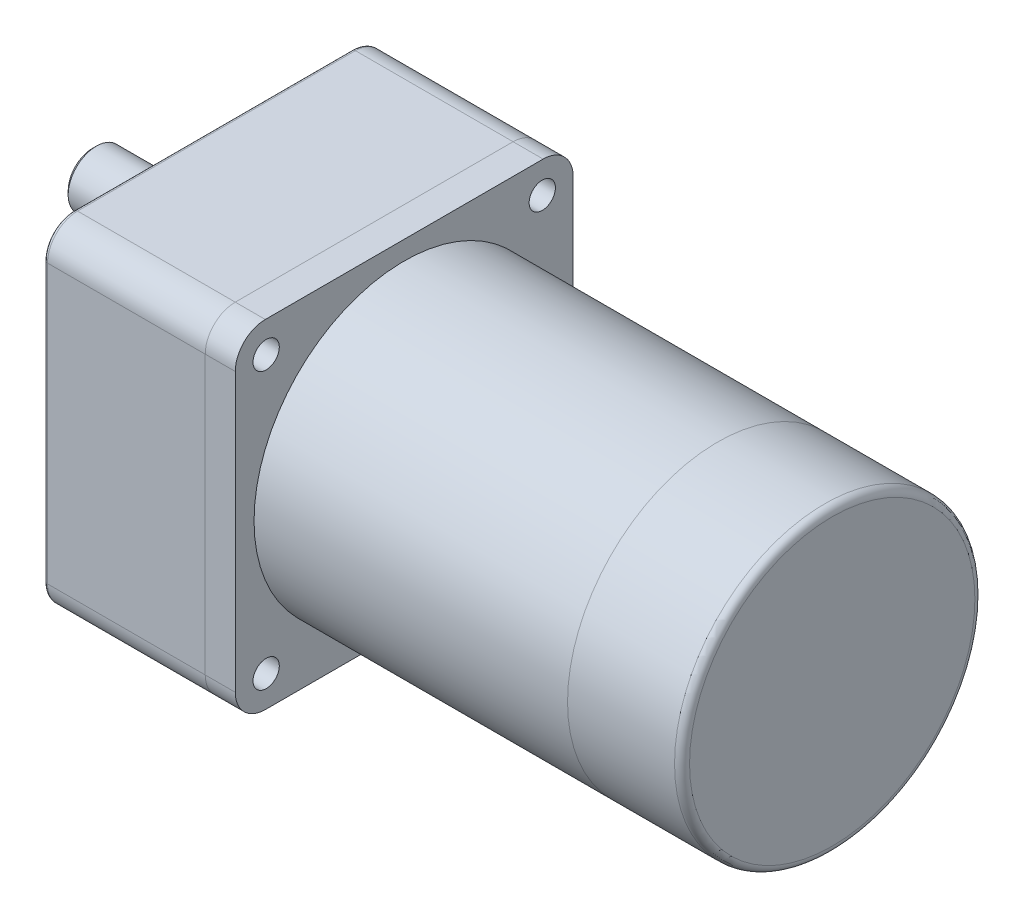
ISO-10303-21;
HEADER;
FILE_DESCRIPTION(('STEP AP214'),'2;1');
FILE_NAME('part.step','',(''),(''),'','','');
FILE_SCHEMA(('AUTOMOTIVE_DESIGN { 1 0 10303 214 1 1 1 1 }'));
ENDSEC;
DATA;
#1=APPLICATION_CONTEXT('core data for automotive mechanical design processes');
#2=APPLICATION_PROTOCOL_DEFINITION('international standard','automotive_design',2000,#1);
#3=PRODUCT_CONTEXT('',#1,'mechanical');
#4=PRODUCT('Part','Part','',(#3));
#5=PRODUCT_RELATED_PRODUCT_CATEGORY('part','',(#4));
#6=PRODUCT_DEFINITION_FORMATION('','',#4);
#7=PRODUCT_DEFINITION_CONTEXT('part definition',#1,'design');
#8=PRODUCT_DEFINITION('design','',#6,#7);
#9=PRODUCT_DEFINITION_SHAPE('','',#8);
#10=(LENGTH_UNIT() NAMED_UNIT(*) SI_UNIT(.MILLI.,.METRE.));
#11=(NAMED_UNIT(*) PLANE_ANGLE_UNIT() SI_UNIT($,.RADIAN.));
#12=(NAMED_UNIT(*) SI_UNIT($,.STERADIAN.) SOLID_ANGLE_UNIT());
#13=UNCERTAINTY_MEASURE_WITH_UNIT(LENGTH_MEASURE(1.E-05),#10,'distance_accuracy_value','');
#14=(GEOMETRIC_REPRESENTATION_CONTEXT(3) GLOBAL_UNCERTAINTY_ASSIGNED_CONTEXT((#13)) GLOBAL_UNIT_ASSIGNED_CONTEXT((#10,
#11,#12)) REPRESENTATION_CONTEXT('',''));
#15=CARTESIAN_POINT('',(0.,0.,0.));
#16=DIRECTION('',(0.,0.,1.));
#17=DIRECTION('',(1.,0.,0.));
#18=AXIS2_PLACEMENT_3D('',#15,#16,#17);
#19=CARTESIAN_POINT('',(-32.,18.,0.));
#20=DIRECTION('',(1.,0.,0.));
#21=DIRECTION('',(0.,0.,-1.));
#22=AXIS2_PLACEMENT_3D('',#19,#20,#21);
#23=CYLINDRICAL_SURFACE('',#22,7.5);
#24=CARTESIAN_POINT('',(-3.,18.,0.));
#25=DIRECTION('',(-1.,0.,0.));
#26=DIRECTION('',(0.,0.,1.));
#27=AXIS2_PLACEMENT_3D('',#24,#25,#26);
#28=CIRCLE('',#27,7.5);
#29=CARTESIAN_POINT('',(-3.,18.,7.5));
#30=VERTEX_POINT('',#29);
#31=EDGE_CURVE('E126',#30,#30,#28,.T.);
#32=ORIENTED_EDGE('',*,*,#31,.T.);
#33=EDGE_LOOP('',(#32));
#34=FACE_BOUND('',#33,.T.);
#35=DIRECTION('',(1.,0.,0.));
#36=VECTOR('',#35,1.);
#37=CARTESIAN_POINT('',(-32.,20.5,-7.07106781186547));
#38=LINE('',#37,#36);
#39=CARTESIAN_POINT('',(-31.,20.5,-7.07106781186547));
#40=VERTEX_POINT('',#39);
#41=CARTESIAN_POINT('',(-9.5,20.5,-7.07106781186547));
#42=VERTEX_POINT('',#41);
#43=EDGE_CURVE('E115',#40,#42,#38,.T.);
#44=ORIENTED_EDGE('',*,*,#43,.F.);
#45=CARTESIAN_POINT('',(-31.,18.,0.));
#46=DIRECTION('',(-1.,0.,0.));
#47=DIRECTION('',(0.,0.,1.));
#48=AXIS2_PLACEMENT_3D('',#45,#46,#47);
#49=CIRCLE('',#48,7.5);
#50=CARTESIAN_POINT('',(-31.,15.5,-7.07106781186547));
#51=VERTEX_POINT('',#50);
#52=EDGE_CURVE('E59',#40,#51,#49,.F.);
#53=ORIENTED_EDGE('',*,*,#52,.T.);
#54=DIRECTION('',(1.,0.,0.));
#55=VECTOR('',#54,1.);
#56=CARTESIAN_POINT('',(-32.,15.5,-7.07106781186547));
#57=LINE('',#56,#55);
#58=CARTESIAN_POINT('',(-9.5,15.5,-7.07106781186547));
#59=VERTEX_POINT('',#58);
#60=EDGE_CURVE('E117',#59,#51,#57,.F.);
#61=ORIENTED_EDGE('',*,*,#60,.F.);
#62=CARTESIAN_POINT('',(-9.5,20.5,-7.07106781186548));
#63=CARTESIAN_POINT('',(-9.43179292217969,20.5000089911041,-7.07105693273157));
#64=CARTESIAN_POINT('',(-9.36359192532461,20.4972088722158,-7.07205443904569));
#65=CARTESIAN_POINT('',(-9.22771896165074,20.4860604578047,-7.07598524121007));
#66=CARTESIAN_POINT('',(-9.16004685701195,20.477713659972,-7.07891801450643));
#67=CARTESIAN_POINT('',(-9.02590951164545,20.455574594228,-7.08662705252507));
#68=CARTESIAN_POINT('',(-8.95944129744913,20.4417984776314,-7.09139784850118));
#69=CARTESIAN_POINT('',(-8.8279917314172,20.4089418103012,-7.10262619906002));
#70=CARTESIAN_POINT('',(-8.7630104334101,20.3898610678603,-7.10908381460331));
#71=CARTESIAN_POINT('',(-8.57103842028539,20.324915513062,-7.13069940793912));
#72=CARTESIAN_POINT('',(-8.44682084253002,20.2713141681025,-7.14811243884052));
#73=CARTESIAN_POINT('',(-8.20912318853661,20.1451778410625,-7.1869703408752));
#74=CARTESIAN_POINT('',(-8.09564976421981,20.0726312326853,-7.20841768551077));
#75=CARTESIAN_POINT('',(-7.8782070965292,19.9076299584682,-7.25386182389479));
#76=CARTESIAN_POINT('',(-7.7747148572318,19.8145628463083,-7.27792189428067));
#77=CARTESIAN_POINT('',(-7.5844828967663,19.6124707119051,-7.32534626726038));
#78=CARTESIAN_POINT('',(-7.497746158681,19.5034428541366,-7.34871044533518));
#79=CARTESIAN_POINT('',(-7.34130177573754,19.2690092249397,-7.39284706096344));
#80=CARTESIAN_POINT('',(-7.27209769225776,19.1432502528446,-7.41353593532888));
#81=CARTESIAN_POINT('',(-7.1560192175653,18.8810730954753,-7.44924021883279));
#82=CARTESIAN_POINT('',(-7.10913800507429,18.7446581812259,-7.46425736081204));
#83=CARTESIAN_POINT('',(-7.04066072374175,18.4700733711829,-7.48647677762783));
#84=CARTESIAN_POINT('',(-7.01824182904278,18.3321295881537,-7.49393272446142));
#85=CARTESIAN_POINT('',(-6.99670924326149,18.0542474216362,-7.50109021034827));
#86=CARTESIAN_POINT('',(-6.99758999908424,17.9143095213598,-7.50079359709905));
#87=CARTESIAN_POINT('',(-7.0221107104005,17.6422403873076,-7.49265096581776));
#88=CARTESIAN_POINT('',(-7.04485659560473,17.5100182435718,-7.48510152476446));
#89=CARTESIAN_POINT('',(-7.1109829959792,17.2513898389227,-7.46367401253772));
#90=CARTESIAN_POINT('',(-7.15436465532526,17.1249839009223,-7.44979559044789));
#91=CARTESIAN_POINT('',(-7.26105342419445,16.8796184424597,-7.41689170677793));
#92=CARTESIAN_POINT('',(-7.32461511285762,16.760778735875,-7.39780094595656));
#93=CARTESIAN_POINT('',(-7.46964987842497,16.5351885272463,-7.35645969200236));
#94=CARTESIAN_POINT('',(-7.55112782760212,16.4284413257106,-7.33420833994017));
#95=CARTESIAN_POINT('',(-7.73417762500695,16.2247566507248,-7.28765679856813));
#96=CARTESIAN_POINT('',(-7.83651385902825,16.128515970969,-7.26330946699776));
#97=CARTESIAN_POINT('',(-8.05610372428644,15.9543199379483,-7.21618726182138));
#98=CARTESIAN_POINT('',(-8.17336215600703,15.8763704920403,-7.19341289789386));
#99=CARTESIAN_POINT('',(-8.42170044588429,15.7399916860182,-7.15175078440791));
#100=CARTESIAN_POINT('',(-8.55295878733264,15.6818674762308,-7.13292537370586));
#101=CARTESIAN_POINT('',(-8.8241174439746,15.5888494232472,-7.10202742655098));
#102=CARTESIAN_POINT('',(-8.96400373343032,15.5539189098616,-7.08994423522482));
#103=CARTESIAN_POINT('',(-9.17104659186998,15.5208546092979,-7.078413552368));
#104=CARTESIAN_POINT('',(-9.23660347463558,15.5130373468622,-7.07566669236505));
#105=CARTESIAN_POINT('',(-9.36809519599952,15.502613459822,-7.07199258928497));
#106=CARTESIAN_POINT('',(-9.43402943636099,15.5000001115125,-7.0710629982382));
#107=CARTESIAN_POINT('',(-9.5,15.5,-7.07106781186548));
#108=B_SPLINE_CURVE_WITH_KNOTS('',3,(#62,#63,#64,#65,#66,#67,#68,#69,#70,#71,#72,#73,#74,#75,
#76,#77,#78,#79,#80,#81,#82,#83,#84,#85,#86,#87,#88,#89,#90,#91,#92,#93,#94,#95,#96,#97,#98,#99,
#100,#101,#102,#103,#104,#105,#106,#107),.UNSPECIFIED.,.F.,.F.,(4,2,2,2,2,2,2,2,2,2,2,2,2,2,2,2,
2,2,2,2,2,2,4),(0.,0.20454621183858,0.409037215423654,0.612924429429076,0.816819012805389,
1.22401016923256,1.63145179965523,2.0532786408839,2.47518051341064,2.90809434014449,
3.34087579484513,3.75860278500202,4.17623021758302,4.57747647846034,4.97874498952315,
5.38529148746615,5.79194868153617,6.21771736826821,6.64362337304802,7.07581676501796,
7.50732520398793,7.70536340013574,7.90314555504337),.UNSPECIFIED.);
#109=EDGE_CURVE('E129',#42,#59,#108,.T.);
#110=ORIENTED_EDGE('',*,*,#109,.F.);
#111=EDGE_LOOP('',(#44,#53,#61,#110));
#112=FACE_BOUND('',#111,.T.);
#113=ADVANCED_FACE('F46',(#34,#112),#23,.T.);
#114=CARTESIAN_POINT('',(-32.,18.,0.));
#115=DIRECTION('',(-1.,0.,0.));
#116=DIRECTION('',(0.,0.,1.));
#117=AXIS2_PLACEMENT_3D('',#114,#115,#116);
#118=PLANE('',#117);
#119=DIRECTION('',(0.,0.,-1.));
#120=VECTOR('',#119,1.);
#121=CARTESIAN_POINT('',(-32.,15.5,-4.5));
#122=LINE('',#121,#120);
#123=CARTESIAN_POINT('',(-32.,15.5,-4.5));
#124=VERTEX_POINT('',#123);
#125=CARTESIAN_POINT('',(-32.,15.5,-6.00000000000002));
#126=VERTEX_POINT('',#125);
#127=EDGE_CURVE('E121',#124,#126,#122,.T.);
#128=ORIENTED_EDGE('',*,*,#127,.T.);
#129=CARTESIAN_POINT('',(-32.,18.,0.));
#130=DIRECTION('',(-1.,0.,0.));
#131=DIRECTION('',(0.,0.,1.));
#132=AXIS2_PLACEMENT_3D('',#129,#130,#131);
#133=CIRCLE('',#132,6.50000000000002);
#134=CARTESIAN_POINT('',(-32.,20.5,-6.00000000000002));
#135=VERTEX_POINT('',#134);
#136=EDGE_CURVE('E135',#126,#135,#133,.T.);
#137=ORIENTED_EDGE('',*,*,#136,.T.);
#138=DIRECTION('',(0.,0.,-1.));
#139=VECTOR('',#138,1.);
#140=CARTESIAN_POINT('',(-32.,20.5,-4.5));
#141=LINE('',#140,#139);
#142=CARTESIAN_POINT('',(-32.,20.5,-4.5));
#143=VERTEX_POINT('',#142);
#144=EDGE_CURVE('E118',#143,#135,#141,.T.);
#145=ORIENTED_EDGE('',*,*,#144,.F.);
#146=DIRECTION('',(0.,-1.,0.));
#147=VECTOR('',#146,1.);
#148=CARTESIAN_POINT('',(-32.,20.5,-4.5));
#149=LINE('',#148,#147);
#150=EDGE_CURVE('E102',#143,#124,#149,.T.);
#151=ORIENTED_EDGE('',*,*,#150,.T.);
#152=EDGE_LOOP('',(#128,#137,#145,#151));
#153=FACE_BOUND('',#152,.T.);
#154=ADVANCED_FACE('F145',(#153),#118,.T.);
#155=CARTESIAN_POINT('',(-3.,18.,0.));
#156=DIRECTION('',(-1.,0.,0.));
#157=DIRECTION('',(0.,0.,1.));
#158=AXIS2_PLACEMENT_3D('',#155,#156,#157);
#159=PLANE('',#158);
#160=ORIENTED_EDGE('',*,*,#31,.F.);
#161=EDGE_LOOP('',(#160));
#162=FACE_BOUND('',#161,.T.);
#163=ADVANCED_FACE('F143',(#162),#159,.F.);
#164=CARTESIAN_POINT('',(-9.5,18.,-4.5));
#165=DIRECTION('',(0.,0.,-1.));
#166=DIRECTION('',(-1.,0.,0.));
#167=AXIS2_PLACEMENT_3D('',#164,#165,#166);
#168=CYLINDRICAL_SURFACE('',#167,2.5);
#169=DIRECTION('',(0.,0.,-1.));
#170=VECTOR('',#169,1.);
#171=CARTESIAN_POINT('',(-9.5,20.5,-4.5));
#172=LINE('',#171,#170);
#173=CARTESIAN_POINT('',(-9.5,20.5,-4.5));
#174=VERTEX_POINT('',#173);
#175=EDGE_CURVE('E110',#174,#42,#172,.T.);
#176=ORIENTED_EDGE('',*,*,#175,.T.);
#177=ORIENTED_EDGE('',*,*,#109,.T.);
#178=DIRECTION('',(0.,0.,-1.));
#179=VECTOR('',#178,1.);
#180=CARTESIAN_POINT('',(-9.5,15.5,-4.5));
#181=LINE('',#180,#179);
#182=CARTESIAN_POINT('',(-9.5,15.5,-4.5));
#183=VERTEX_POINT('',#182);
#184=EDGE_CURVE('E112',#183,#59,#181,.T.);
#185=ORIENTED_EDGE('',*,*,#184,.F.);
#186=CARTESIAN_POINT('',(-9.5,18.,-4.5));
#187=DIRECTION('',(0.,0.,1.));
#188=DIRECTION('',(1.,0.,0.));
#189=AXIS2_PLACEMENT_3D('',#186,#187,#188);
#190=CIRCLE('',#189,2.5);
#191=EDGE_CURVE('E100',#183,#174,#190,.T.);
#192=ORIENTED_EDGE('',*,*,#191,.T.);
#193=EDGE_LOOP('',(#176,#177,#185,#192));
#194=FACE_BOUND('',#193,.T.);
#195=ADVANCED_FACE('F109',(#194),#168,.F.);
#196=CARTESIAN_POINT('',(-9.5,20.5,-4.5));
#197=DIRECTION('',(0.,-1.,0.));
#198=DIRECTION('',(0.,0.,-1.));
#199=AXIS2_PLACEMENT_3D('',#196,#197,#198);
#200=PLANE('',#199);
#201=ORIENTED_EDGE('',*,*,#144,.T.);
#202=CARTESIAN_POINT('',(-32.,20.5,-6.00000000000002));
#203=CARTESIAN_POINT('',(-31.9171731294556,20.5,-6.0897273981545));
#204=CARTESIAN_POINT('',(-31.8341996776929,20.5,-6.17931930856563));
#205=CARTESIAN_POINT('',(-31.6679908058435,20.5,-6.35825867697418));
#206=CARTESIAN_POINT('',(-31.5847553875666,20.5,-6.44760613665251));
#207=CARTESIAN_POINT('',(-31.4180527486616,20.5,-6.62608424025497));
#208=CARTESIAN_POINT('',(-31.3345855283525,20.5,-6.7152148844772));
#209=CARTESIAN_POINT('',(-31.1674427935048,20.5,-6.89328182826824));
#210=CARTESIAN_POINT('',(-31.0837672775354,20.5,-6.98221812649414));
#211=CARTESIAN_POINT('',(-31.,20.5,-7.07106781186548));
#212=B_SPLINE_CURVE_WITH_KNOTS('',3,(#202,#203,#204,#205,#206,#207,#208,#209,#210,#211),
.UNSPECIFIED.,.F.,.F.,(4,2,2,2,4),(0.,0.366335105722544,0.732667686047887,1.0989997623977,
1.46533436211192),.UNSPECIFIED.);
#213=EDGE_CURVE('E73',#135,#40,#212,.T.);
#214=ORIENTED_EDGE('',*,*,#213,.T.);
#215=ORIENTED_EDGE('',*,*,#43,.T.);
#216=ORIENTED_EDGE('',*,*,#175,.F.);
#217=DIRECTION('',(-1.,0.,0.));
#218=VECTOR('',#217,1.);
#219=CARTESIAN_POINT('',(-9.5,20.5,-4.5));
#220=LINE('',#219,#218);
#221=EDGE_CURVE('E97',#174,#143,#220,.T.);
#222=ORIENTED_EDGE('',*,*,#221,.T.);
#223=EDGE_LOOP('',(#201,#214,#215,#216,#222));
#224=FACE_BOUND('',#223,.T.);
#225=ADVANCED_FACE('F114',(#224),#200,.T.);
#226=CARTESIAN_POINT('',(-32.,15.5,-4.5));
#227=DIRECTION('',(0.,1.,0.));
#228=DIRECTION('',(0.,0.,1.));
#229=AXIS2_PLACEMENT_3D('',#226,#227,#228);
#230=PLANE('',#229);
#231=ORIENTED_EDGE('',*,*,#60,.T.);
#232=CARTESIAN_POINT('',(-31.,15.5,-7.07106781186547));
#233=CARTESIAN_POINT('',(-31.0837672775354,15.5,-6.98221812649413));
#234=CARTESIAN_POINT('',(-31.1674427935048,15.5,-6.89328182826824));
#235=CARTESIAN_POINT('',(-31.3345855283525,15.5,-6.7152148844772));
#236=CARTESIAN_POINT('',(-31.4180527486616,15.5,-6.62608424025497));
#237=CARTESIAN_POINT('',(-31.5847553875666,15.5,-6.44760613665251));
#238=CARTESIAN_POINT('',(-31.6679908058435,15.5,-6.35825867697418));
#239=CARTESIAN_POINT('',(-31.8341996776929,15.5,-6.17931930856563));
#240=CARTESIAN_POINT('',(-31.9171731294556,15.5,-6.08972739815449));
#241=CARTESIAN_POINT('',(-32.,15.5,-6.00000000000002));
#242=B_SPLINE_CURVE_WITH_KNOTS('',3,(#232,#233,#234,#235,#236,#237,#238,#239,#240,#241),
.UNSPECIFIED.,.F.,.F.,(4,2,2,2,4),(0.,0.366334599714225,0.732666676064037,1.09899925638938,
1.46533436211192),.UNSPECIFIED.);
#243=EDGE_CURVE('E12',#51,#126,#242,.T.);
#244=ORIENTED_EDGE('',*,*,#243,.T.);
#245=ORIENTED_EDGE('',*,*,#127,.F.);
#246=DIRECTION('',(1.,0.,0.));
#247=VECTOR('',#246,1.);
#248=CARTESIAN_POINT('',(-32.,15.5,-4.5));
#249=LINE('',#248,#247);
#250=EDGE_CURVE('E167',#124,#183,#249,.T.);
#251=ORIENTED_EDGE('',*,*,#250,.T.);
#252=ORIENTED_EDGE('',*,*,#184,.T.);
#253=EDGE_LOOP('',(#231,#244,#245,#251,#252));
#254=FACE_BOUND('',#253,.T.);
#255=ADVANCED_FACE('F171',(#254),#230,.T.);
#256=CARTESIAN_POINT('',(-9.5,18.,-4.5));
#257=DIRECTION('',(0.,0.,1.));
#258=DIRECTION('',(1.,0.,0.));
#259=AXIS2_PLACEMENT_3D('',#256,#257,#258);
#260=PLANE('',#259);
#261=ORIENTED_EDGE('',*,*,#191,.F.);
#262=ORIENTED_EDGE('',*,*,#250,.F.);
#263=ORIENTED_EDGE('',*,*,#150,.F.);
#264=ORIENTED_EDGE('',*,*,#221,.F.);
#265=EDGE_LOOP('',(#261,#262,#263,#264));
#266=FACE_BOUND('',#265,.T.);
#267=ADVANCED_FACE('F99',(#266),#260,.F.);
#268=CARTESIAN_POINT('',(-32.,18.,0.));
#269=DIRECTION('',(1.,0.,0.));
#270=DIRECTION('',(0.,0.,-1.));
#271=AXIS2_PLACEMENT_3D('',#268,#269,#270);
#272=CONICAL_SURFACE('',#271,6.50000000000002,0.785398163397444);
#273=ORIENTED_EDGE('',*,*,#243,.F.);
#274=ORIENTED_EDGE('',*,*,#52,.F.);
#275=ORIENTED_EDGE('',*,*,#213,.F.);
#276=ORIENTED_EDGE('',*,*,#136,.F.);
#277=EDGE_LOOP('',(#273,#274,#275,#276));
#278=FACE_BOUND('',#277,.T.);
#279=ADVANCED_FACE('F48',(#278),#272,.T.);
#280=CLOSED_SHELL('',(#113,#154,#163,#195,#225,#255,#267,#279));
#281=MANIFOLD_SOLID_BREP('B2',#280);
#282=CARTESIAN_POINT('',(-3.,18.,0.));
#283=DIRECTION('',(1.,0.,0.));
#284=DIRECTION('',(0.,0.,-1.));
#285=AXIS2_PLACEMENT_3D('',#282,#283,#284);
#286=CYLINDRICAL_SURFACE('',#285,16.);
#287=CARTESIAN_POINT('',(-2.5,18.,0.));
#288=DIRECTION('',(-1.,0.,0.));
#289=DIRECTION('',(0.,0.,1.));
#290=AXIS2_PLACEMENT_3D('',#287,#288,#289);
#291=CIRCLE('',#290,16.);
#292=CARTESIAN_POINT('',(-2.5,18.,16.));
#293=VERTEX_POINT('',#292);
#294=EDGE_CURVE('E45',#293,#293,#291,.F.);
#295=ORIENTED_EDGE('',*,*,#294,.T.);
#296=EDGE_LOOP('',(#295));
#297=FACE_BOUND('',#296,.T.);
#298=CARTESIAN_POINT('',(0.,18.,0.));
#299=DIRECTION('',(-1.,0.,0.));
#300=DIRECTION('',(0.,0.,1.));
#301=AXIS2_PLACEMENT_3D('',#298,#299,#300);
#302=CIRCLE('',#301,16.);
#303=CARTESIAN_POINT('',(0.,18.,16.));
#304=VERTEX_POINT('',#303);
#305=EDGE_CURVE('E245',#304,#304,#302,.T.);
#306=ORIENTED_EDGE('',*,*,#305,.T.);
#307=EDGE_LOOP('',(#306));
#308=FACE_BOUND('',#307,.T.);
#309=ADVANCED_FACE('F234',(#297,#308),#286,.T.);
#310=CARTESIAN_POINT('',(-3.,18.,0.));
#311=DIRECTION('',(-1.,0.,0.));
#312=DIRECTION('',(0.,0.,1.));
#313=AXIS2_PLACEMENT_3D('',#310,#311,#312);
#314=PLANE('',#313);
#315=CARTESIAN_POINT('',(-3.,18.,0.));
#316=DIRECTION('',(-1.,0.,0.));
#317=DIRECTION('',(0.,0.,1.));
#318=AXIS2_PLACEMENT_3D('',#315,#316,#317);
#319=CIRCLE('',#318,15.5);
#320=CARTESIAN_POINT('',(-3.,18.,15.5));
#321=VERTEX_POINT('',#320);
#322=EDGE_CURVE('E241',#321,#321,#319,.T.);
#323=ORIENTED_EDGE('',*,*,#322,.T.);
#324=EDGE_LOOP('',(#323));
#325=FACE_BOUND('',#324,.T.);
#326=ADVANCED_FACE('F255',(#325),#314,.T.);
#327=CARTESIAN_POINT('',(0.,18.,0.));
#328=DIRECTION('',(-1.,0.,0.));
#329=DIRECTION('',(0.,0.,1.));
#330=AXIS2_PLACEMENT_3D('',#327,#328,#329);
#331=PLANE('',#330);
#332=ORIENTED_EDGE('',*,*,#305,.F.);
#333=EDGE_LOOP('',(#332));
#334=FACE_BOUND('',#333,.T.);
#335=ADVANCED_FACE('F253',(#334),#331,.F.);
#336=CARTESIAN_POINT('',(-2.5,18.,0.));
#337=DIRECTION('',(-1.,0.,0.));
#338=DIRECTION('',(0.,0.,1.));
#339=AXIS2_PLACEMENT_3D('',#336,#337,#338);
#340=TOROIDAL_SURFACE('',#339,15.5,0.5);
#341=ORIENTED_EDGE('',*,*,#294,.F.);
#342=EDGE_LOOP('',(#341));
#343=FACE_BOUND('',#342,.T.);
#344=ORIENTED_EDGE('',*,*,#322,.F.);
#345=EDGE_LOOP('',(#344));
#346=FACE_BOUND('',#345,.T.);
#347=ADVANCED_FACE('F236',(#343,#346),#340,.T.);
#348=CLOSED_SHELL('',(#309,#326,#335,#347));
#349=MANIFOLD_SOLID_BREP('B6',#348);
#350=CARTESIAN_POINT('',(165.,0.,0.));
#351=DIRECTION('',(-1.,0.,0.));
#352=DIRECTION('',(0.,0.,1.));
#353=AXIS2_PLACEMENT_3D('',#350,#351,#352);
#354=CYLINDRICAL_SURFACE('',#353,40.);
#355=CARTESIAN_POINT('',(163.,0.,0.));
#356=DIRECTION('',(1.,0.,0.));
#357=DIRECTION('',(0.,0.,-1.));
#358=AXIS2_PLACEMENT_3D('',#355,#356,#357);
#359=CIRCLE('',#358,40.);
#360=CARTESIAN_POINT('',(163.,0.,40.));
#361=VERTEX_POINT('',#360);
#362=EDGE_CURVE('E233',#361,#361,#359,.F.);
#363=CARTESIAN_POINT('',(134.5,0.,0.));
#364=DIRECTION('',(1.,0.,0.));
#365=DIRECTION('',(0.,0.,-1.));
#366=AXIS2_PLACEMENT_3D('',#363,#364,#365);
#367=CIRCLE('',#366,40.);
#368=CARTESIAN_POINT('',(134.5,0.,40.));
#369=VERTEX_POINT('',#368);
#370=EDGE_CURVE('E309',#369,#369,#367,.T.);
#371=CARTESIAN_POINT('',(163.,0.,40.));
#372=CARTESIAN_POINT('',(162.703125,0.,40.));
#373=CARTESIAN_POINT('',(162.40625,0.,40.));
#374=CARTESIAN_POINT('',(161.8125,0.,40.));
#375=CARTESIAN_POINT('',(161.515625,0.,40.));
#376=CARTESIAN_POINT('',(160.921875,0.,40.));
#377=CARTESIAN_POINT('',(160.625,0.,40.));
#378=CARTESIAN_POINT('',(160.03125,0.,40.));
#379=CARTESIAN_POINT('',(159.734375,0.,40.));
#380=CARTESIAN_POINT('',(159.140625,0.,40.));
#381=CARTESIAN_POINT('',(158.84375,0.,40.));
#382=CARTESIAN_POINT('',(158.25,0.,40.));
#383=CARTESIAN_POINT('',(157.953125,0.,40.));
#384=CARTESIAN_POINT('',(157.359375,0.,40.));
#385=CARTESIAN_POINT('',(157.0625,0.,40.));
#386=CARTESIAN_POINT('',(156.46875,0.,40.));
#387=CARTESIAN_POINT('',(156.171875,0.,40.));
#388=CARTESIAN_POINT('',(155.578125,0.,40.));
#389=CARTESIAN_POINT('',(155.28125,0.,40.));
#390=CARTESIAN_POINT('',(154.6875,0.,40.));
#391=CARTESIAN_POINT('',(154.390625,0.,40.));
#392=CARTESIAN_POINT('',(153.796875,0.,40.));
#393=CARTESIAN_POINT('',(153.5,0.,40.));
#394=CARTESIAN_POINT('',(152.90625,0.,40.));
#395=CARTESIAN_POINT('',(152.609375,0.,40.));
#396=CARTESIAN_POINT('',(152.015625,0.,40.));
#397=CARTESIAN_POINT('',(151.71875,0.,40.));
#398=CARTESIAN_POINT('',(151.125,0.,40.));
#399=CARTESIAN_POINT('',(150.828125,0.,40.));
#400=CARTESIAN_POINT('',(150.234375,0.,40.));
#401=CARTESIAN_POINT('',(149.9375,0.,40.));
#402=CARTESIAN_POINT('',(149.34375,0.,40.));
#403=CARTESIAN_POINT('',(149.046875,0.,40.));
#404=CARTESIAN_POINT('',(148.453125,0.,40.));
#405=CARTESIAN_POINT('',(148.15625,0.,40.));
#406=CARTESIAN_POINT('',(147.5625,0.,40.));
#407=CARTESIAN_POINT('',(147.265625,0.,40.));
#408=CARTESIAN_POINT('',(146.671875,0.,40.));
#409=CARTESIAN_POINT('',(146.375,0.,40.));
#410=CARTESIAN_POINT('',(145.78125,0.,40.));
#411=CARTESIAN_POINT('',(145.484375,0.,40.));
#412=CARTESIAN_POINT('',(144.890625,0.,40.));
#413=CARTESIAN_POINT('',(144.59375,0.,40.));
#414=CARTESIAN_POINT('',(144.,0.,40.));
#415=CARTESIAN_POINT('',(143.703125,0.,40.));
#416=CARTESIAN_POINT('',(143.109375,0.,40.));
#417=CARTESIAN_POINT('',(142.8125,0.,40.));
#418=CARTESIAN_POINT('',(142.21875,0.,40.));
#419=CARTESIAN_POINT('',(141.921875,0.,40.));
#420=CARTESIAN_POINT('',(141.328125,0.,40.));
#421=CARTESIAN_POINT('',(141.03125,0.,40.));
#422=CARTESIAN_POINT('',(140.4375,0.,40.));
#423=CARTESIAN_POINT('',(140.140625,0.,40.));
#424=CARTESIAN_POINT('',(139.546875,0.,40.));
#425=CARTESIAN_POINT('',(139.25,0.,40.));
#426=CARTESIAN_POINT('',(138.65625,0.,40.));
#427=CARTESIAN_POINT('',(138.359375,0.,40.));
#428=CARTESIAN_POINT('',(137.765625,0.,40.));
#429=CARTESIAN_POINT('',(137.46875,0.,40.));
#430=CARTESIAN_POINT('',(136.875,0.,40.));
#431=CARTESIAN_POINT('',(136.578125,0.,40.));
#432=CARTESIAN_POINT('',(135.984375,0.,40.));
#433=CARTESIAN_POINT('',(135.6875,0.,40.));
#434=CARTESIAN_POINT('',(135.09375,0.,40.));
#435=CARTESIAN_POINT('',(134.796875,0.,40.));
#436=CARTESIAN_POINT('',(134.5,0.,40.));
#437=B_SPLINE_CURVE_WITH_KNOTS('',3,(#371,#372,#373,#374,#375,#376,#377,#378,#379,#380,#381,
#382,#383,#384,#385,#386,#387,#388,#389,#390,#391,#392,#393,#394,#395,#396,#397,#398,#399,#400,
#401,#402,#403,#404,#405,#406,#407,#408,#409,#410,#411,#412,#413,#414,#415,#416,#417,#418,#419,
#420,#421,#422,#423,#424,#425,#426,#427,#428,#429,#430,#431,#432,#433,#434,#435,#436),
.UNSPECIFIED.,.F.,.F.,(4,2,2,2,2,2,2,2,2,2,2,2,2,2,2,2,2,2,2,2,2,2,2,2,2,2,2,2,2,2,2,2,4),(0.,
0.890625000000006,1.78125000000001,2.67187500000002,3.56250000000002,4.453125,5.34375000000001,
6.23437500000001,7.12500000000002,8.01562500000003,8.90625,9.79687500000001,10.6875,11.578125,
12.46875,13.359375,14.25,15.140625,16.03125,16.921875,17.8125,18.703125,19.59375,20.484375,
21.375,22.265625,23.15625,24.046875,24.9375,25.828125,26.71875,27.609375,28.5),.UNSPECIFIED.);
#438=EDGE_CURVE('BSEAM298',#361,#369,#437,.T.);
#439=ORIENTED_EDGE('',*,*,#362,.T.);
#440=ORIENTED_EDGE('',*,*,#370,.T.);
#441=ORIENTED_EDGE('',*,*,#438,.T.);
#442=ORIENTED_EDGE('',*,*,#438,.F.);
#443=EDGE_LOOP('',(#439,#441,#440,#442));
#444=FACE_BOUND('',#443,.T.);
#445=ADVANCED_FACE('F298',(#444),#354,.T.);
#446=CARTESIAN_POINT('',(165.,0.,0.));
#447=DIRECTION('',(1.,0.,0.));
#448=DIRECTION('',(0.,0.,-1.));
#449=AXIS2_PLACEMENT_3D('',#446,#447,#448);
#450=PLANE('',#449);
#451=CARTESIAN_POINT('',(165.,0.,0.));
#452=DIRECTION('',(1.,0.,0.));
#453=DIRECTION('',(0.,0.,-1.));
#454=AXIS2_PLACEMENT_3D('',#451,#452,#453);
#455=CIRCLE('',#454,38.);
#456=CARTESIAN_POINT('',(165.,0.,-38.));
#457=VERTEX_POINT('',#456);
#458=EDGE_CURVE('E305',#457,#457,#455,.T.);
#459=ORIENTED_EDGE('',*,*,#458,.T.);
#460=EDGE_LOOP('',(#459));
#461=FACE_BOUND('',#460,.T.);
#462=ADVANCED_FACE('F319',(#461),#450,.T.);
#463=CARTESIAN_POINT('',(134.5,0.,0.));
#464=DIRECTION('',(1.,0.,0.));
#465=DIRECTION('',(0.,0.,-1.));
#466=AXIS2_PLACEMENT_3D('',#463,#464,#465);
#467=PLANE('',#466);
#468=ORIENTED_EDGE('',*,*,#370,.F.);
#469=EDGE_LOOP('',(#468));
#470=FACE_BOUND('',#469,.T.);
#471=ADVANCED_FACE('F317',(#470),#467,.F.);
#472=CARTESIAN_POINT('',(163.,0.,0.));
#473=DIRECTION('',(1.,0.,0.));
#474=DIRECTION('',(0.,0.,-1.));
#475=AXIS2_PLACEMENT_3D('',#472,#473,#474);
#476=TOROIDAL_SURFACE('',#475,38.,2.);
#477=ORIENTED_EDGE('',*,*,#362,.F.);
#478=EDGE_LOOP('',(#477));
#479=FACE_BOUND('',#478,.T.);
#480=ORIENTED_EDGE('',*,*,#458,.F.);
#481=EDGE_LOOP('',(#480));
#482=FACE_BOUND('',#481,.T.);
#483=ADVANCED_FACE('F300',(#479,#482),#476,.T.);
#484=CLOSED_SHELL('',(#445,#462,#471,#483));
#485=MANIFOLD_SOLID_BREP('B40',#484);
#486=CARTESIAN_POINT('',(134.5,0.,0.));
#487=DIRECTION('',(-1.,0.,0.));
#488=DIRECTION('',(0.,0.,1.));
#489=AXIS2_PLACEMENT_3D('',#486,#487,#488);
#490=CYLINDRICAL_SURFACE('',#489,40.);
#491=CARTESIAN_POINT('',(134.5,0.,0.));
#492=DIRECTION('',(1.,0.,0.));
#493=DIRECTION('',(0.,0.,-1.));
#494=AXIS2_PLACEMENT_3D('',#491,#492,#493);
#495=CIRCLE('',#494,40.);
#496=CARTESIAN_POINT('',(134.5,0.,40.));
#497=VERTEX_POINT('',#496);
#498=EDGE_CURVE('E297',#497,#497,#495,.T.);
#499=CARTESIAN_POINT('',(51.,0.,0.));
#500=DIRECTION('',(1.,0.,0.));
#501=DIRECTION('',(0.,0.,-1.));
#502=AXIS2_PLACEMENT_3D('',#499,#500,#501);
#503=CIRCLE('',#502,40.);
#504=CARTESIAN_POINT('',(51.,0.,40.));
#505=VERTEX_POINT('',#504);
#506=EDGE_CURVE('E367',#505,#505,#503,.T.);
#507=CARTESIAN_POINT('',(134.5,0.,40.));
#508=CARTESIAN_POINT('',(133.630208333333,0.,40.));
#509=CARTESIAN_POINT('',(132.760416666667,0.,40.));
#510=CARTESIAN_POINT('',(131.020833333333,0.,40.));
#511=CARTESIAN_POINT('',(130.151041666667,0.,40.));
#512=CARTESIAN_POINT('',(128.411458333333,0.,40.));
#513=CARTESIAN_POINT('',(127.541666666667,0.,40.));
#514=CARTESIAN_POINT('',(125.802083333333,0.,40.));
#515=CARTESIAN_POINT('',(124.932291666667,0.,40.));
#516=CARTESIAN_POINT('',(123.192708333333,0.,40.));
#517=CARTESIAN_POINT('',(122.322916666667,0.,40.));
#518=CARTESIAN_POINT('',(120.583333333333,0.,40.));
#519=CARTESIAN_POINT('',(119.713541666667,0.,40.));
#520=CARTESIAN_POINT('',(117.973958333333,0.,40.));
#521=CARTESIAN_POINT('',(117.104166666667,0.,40.));
#522=CARTESIAN_POINT('',(115.364583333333,0.,40.));
#523=CARTESIAN_POINT('',(114.494791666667,0.,40.));
#524=CARTESIAN_POINT('',(112.755208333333,0.,40.));
#525=CARTESIAN_POINT('',(111.885416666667,0.,40.));
#526=CARTESIAN_POINT('',(110.145833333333,0.,40.));
#527=CARTESIAN_POINT('',(109.276041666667,0.,40.));
#528=CARTESIAN_POINT('',(107.536458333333,0.,40.));
#529=CARTESIAN_POINT('',(106.666666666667,0.,40.));
#530=CARTESIAN_POINT('',(104.927083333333,0.,40.));
#531=CARTESIAN_POINT('',(104.057291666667,0.,40.));
#532=CARTESIAN_POINT('',(102.317708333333,0.,40.));
#533=CARTESIAN_POINT('',(101.447916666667,0.,40.));
#534=CARTESIAN_POINT('',(99.7083333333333,0.,40.));
#535=CARTESIAN_POINT('',(98.8385416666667,0.,40.));
#536=CARTESIAN_POINT('',(97.0989583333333,0.,40.));
#537=CARTESIAN_POINT('',(96.2291666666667,0.,40.));
#538=CARTESIAN_POINT('',(94.4895833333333,0.,40.));
#539=CARTESIAN_POINT('',(93.6197916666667,0.,40.));
#540=CARTESIAN_POINT('',(91.8802083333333,0.,40.));
#541=CARTESIAN_POINT('',(91.0104166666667,0.,40.));
#542=CARTESIAN_POINT('',(89.2708333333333,0.,40.));
#543=CARTESIAN_POINT('',(88.4010416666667,0.,40.));
#544=CARTESIAN_POINT('',(86.6614583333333,0.,40.));
#545=CARTESIAN_POINT('',(85.7916666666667,0.,40.));
#546=CARTESIAN_POINT('',(84.0520833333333,0.,40.));
#547=CARTESIAN_POINT('',(83.1822916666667,0.,40.));
#548=CARTESIAN_POINT('',(81.4427083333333,0.,40.));
#549=CARTESIAN_POINT('',(80.5729166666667,0.,40.));
#550=CARTESIAN_POINT('',(78.8333333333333,0.,40.));
#551=CARTESIAN_POINT('',(77.9635416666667,0.,40.));
#552=CARTESIAN_POINT('',(76.2239583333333,0.,40.));
#553=CARTESIAN_POINT('',(75.3541666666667,0.,40.));
#554=CARTESIAN_POINT('',(73.6145833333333,0.,40.));
#555=CARTESIAN_POINT('',(72.7447916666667,0.,40.));
#556=CARTESIAN_POINT('',(71.0052083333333,0.,40.));
#557=CARTESIAN_POINT('',(70.1354166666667,0.,40.));
#558=CARTESIAN_POINT('',(68.3958333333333,0.,40.));
#559=CARTESIAN_POINT('',(67.5260416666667,0.,40.));
#560=CARTESIAN_POINT('',(65.7864583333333,0.,40.));
#561=CARTESIAN_POINT('',(64.9166666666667,0.,40.));
#562=CARTESIAN_POINT('',(63.1770833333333,0.,40.));
#563=CARTESIAN_POINT('',(62.3072916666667,0.,40.));
#564=CARTESIAN_POINT('',(60.5677083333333,0.,40.));
#565=CARTESIAN_POINT('',(59.6979166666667,0.,40.));
#566=CARTESIAN_POINT('',(57.9583333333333,0.,40.));
#567=CARTESIAN_POINT('',(57.0885416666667,0.,40.));
#568=CARTESIAN_POINT('',(55.3489583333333,0.,40.));
#569=CARTESIAN_POINT('',(54.4791666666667,0.,40.));
#570=CARTESIAN_POINT('',(52.7395833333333,0.,40.));
#571=CARTESIAN_POINT('',(51.8697916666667,0.,40.));
#572=CARTESIAN_POINT('',(51.,0.,40.));
#573=B_SPLINE_CURVE_WITH_KNOTS('',3,(#507,#508,#509,#510,#511,#512,#513,#514,#515,#516,#517,
#518,#519,#520,#521,#522,#523,#524,#525,#526,#527,#528,#529,#530,#531,#532,#533,#534,#535,#536,
#537,#538,#539,#540,#541,#542,#543,#544,#545,#546,#547,#548,#549,#550,#551,#552,#553,#554,#555,
#556,#557,#558,#559,#560,#561,#562,#563,#564,#565,#566,#567,#568,#569,#570,#571,#572),
.UNSPECIFIED.,.F.,.F.,(4,2,2,2,2,2,2,2,2,2,2,2,2,2,2,2,2,2,2,2,2,2,2,2,2,2,2,2,2,2,2,2,4),(0.,
2.609375,5.21874999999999,7.82812499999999,10.4375,13.046875,15.65625,18.265625,20.875,
23.484375,26.09375,28.703125,31.3125,33.921875,36.53125,39.140625,41.75,44.359375,46.96875,
49.578125,52.1875,54.796875,57.40625,60.015625,62.625,65.234375,67.84375,70.453125,73.0625,
75.671875,78.28125,80.890625,83.5),.UNSPECIFIED.);
#574=EDGE_CURVE('BSEAM364',#497,#505,#573,.T.);
#575=ORIENTED_EDGE('',*,*,#498,.F.);
#576=ORIENTED_EDGE('',*,*,#506,.T.);
#577=ORIENTED_EDGE('',*,*,#574,.T.);
#578=ORIENTED_EDGE('',*,*,#574,.F.);
#579=EDGE_LOOP('',(#575,#577,#576,#578));
#580=FACE_BOUND('',#579,.T.);
#581=ADVANCED_FACE('F364',(#580),#490,.T.);
#582=CARTESIAN_POINT('',(134.5,0.,0.));
#583=DIRECTION('',(1.,0.,0.));
#584=DIRECTION('',(0.,0.,-1.));
#585=AXIS2_PLACEMENT_3D('',#582,#583,#584);
#586=PLANE('',#585);
#587=ORIENTED_EDGE('',*,*,#498,.T.);
#588=EDGE_LOOP('',(#587));
#589=FACE_BOUND('',#588,.T.);
#590=ADVANCED_FACE('F379',(#589),#586,.T.);
#591=CARTESIAN_POINT('',(51.,0.,0.));
#592=DIRECTION('',(1.,0.,0.));
#593=DIRECTION('',(0.,0.,-1.));
#594=AXIS2_PLACEMENT_3D('',#591,#592,#593);
#595=PLANE('',#594);
#596=ORIENTED_EDGE('',*,*,#506,.F.);
#597=EDGE_LOOP('',(#596));
#598=FACE_BOUND('',#597,.T.);
#599=ADVANCED_FACE('F377',(#598),#595,.F.);
#600=CLOSED_SHELL('',(#581,#590,#599));
#601=MANIFOLD_SOLID_BREP('B228',#600);
#602=CARTESIAN_POINT('',(51.,37.,-37.));
#603=DIRECTION('',(-1.,0.,0.));
#604=DIRECTION('',(0.,0.,1.));
#605=AXIS2_PLACEMENT_3D('',#602,#603,#604);
#606=CYLINDRICAL_SURFACE('',#605,8.);
#607=CARTESIAN_POINT('',(43.,37.,-37.));
#608=DIRECTION('',(1.,0.,0.));
#609=DIRECTION('',(0.,0.,1.));
#610=AXIS2_PLACEMENT_3D('',#607,#608,#609);
#611=CIRCLE('',#610,8.);
#612=CARTESIAN_POINT('',(43.,37.,-45.));
#613=VERTEX_POINT('',#612);
#614=CARTESIAN_POINT('',(43.,45.,-36.9999999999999));
#615=VERTEX_POINT('',#614);
#616=EDGE_CURVE('E512',#613,#615,#611,.T.);
#617=ORIENTED_EDGE('',*,*,#616,.T.);
#618=DIRECTION('',(-1.,0.,0.));
#619=VECTOR('',#618,1.);
#620=CARTESIAN_POINT('',(51.,45.,-36.9999999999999));
#621=LINE('',#620,#619);
#622=CARTESIAN_POINT('',(51.,45.,-36.9999999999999));
#623=VERTEX_POINT('',#622);
#624=EDGE_CURVE('E362',#623,#615,#621,.T.);
#625=ORIENTED_EDGE('',*,*,#624,.F.);
#626=CARTESIAN_POINT('',(51.,37.,-37.));
#627=DIRECTION('',(1.,0.,0.));
#628=DIRECTION('',(0.,0.,1.));
#629=AXIS2_PLACEMENT_3D('',#626,#627,#628);
#630=CIRCLE('',#629,8.);
#631=CARTESIAN_POINT('',(51.,37.,-45.));
#632=VERTEX_POINT('',#631);
#633=EDGE_CURVE('E526',#632,#623,#630,.T.);
#634=ORIENTED_EDGE('',*,*,#633,.F.);
#635=DIRECTION('',(-1.,0.,0.));
#636=VECTOR('',#635,1.);
#637=CARTESIAN_POINT('',(51.,37.,-45.));
#638=LINE('',#637,#636);
#639=EDGE_CURVE('E508',#632,#613,#638,.T.);
#640=ORIENTED_EDGE('',*,*,#639,.T.);
#641=EDGE_LOOP('',(#617,#625,#634,#640));
#642=FACE_BOUND('',#641,.T.);
#643=ADVANCED_FACE('F414',(#642),#606,.T.);
#644=CARTESIAN_POINT('',(51.,45.,36.9999999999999));
#645=DIRECTION('',(0.,-1.,0.));
#646=DIRECTION('',(0.,0.,-1.));
#647=AXIS2_PLACEMENT_3D('',#644,#645,#646);
#648=PLANE('',#647);
#649=DIRECTION('',(0.,0.,1.));
#650=VECTOR('',#649,1.);
#651=CARTESIAN_POINT('',(43.,45.,36.9999999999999));
#652=LINE('',#651,#650);
#653=CARTESIAN_POINT('',(43.,45.,36.9999999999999));
#654=VERTEX_POINT('',#653);
#655=EDGE_CURVE('E515',#615,#654,#652,.T.);
#656=ORIENTED_EDGE('',*,*,#655,.T.);
#657=DIRECTION('',(-1.,0.,0.));
#658=VECTOR('',#657,1.);
#659=CARTESIAN_POINT('',(51.,45.,36.9999999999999));
#660=LINE('',#659,#658);
#661=CARTESIAN_POINT('',(51.,45.,36.9999999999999));
#662=VERTEX_POINT('',#661);
#663=EDGE_CURVE('E423',#662,#654,#660,.T.);
#664=ORIENTED_EDGE('',*,*,#663,.F.);
#665=DIRECTION('',(0.,0.,1.));
#666=VECTOR('',#665,1.);
#667=CARTESIAN_POINT('',(51.,45.,36.9999999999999));
#668=LINE('',#667,#666);
#669=EDGE_CURVE('E475',#623,#662,#668,.T.);
#670=ORIENTED_EDGE('',*,*,#669,.F.);
#671=ORIENTED_EDGE('',*,*,#624,.T.);
#672=EDGE_LOOP('',(#656,#664,#670,#671));
#673=FACE_BOUND('',#672,.T.);
#674=ADVANCED_FACE('F580',(#673),#648,.F.);
#675=CARTESIAN_POINT('',(51.,37.,37.));
#676=DIRECTION('',(-1.,0.,0.));
#677=DIRECTION('',(0.,0.,1.));
#678=AXIS2_PLACEMENT_3D('',#675,#676,#677);
#679=CYLINDRICAL_SURFACE('',#678,8.);
#680=CARTESIAN_POINT('',(43.,37.,37.));
#681=DIRECTION('',(1.,0.,0.));
#682=DIRECTION('',(0.,0.,1.));
#683=AXIS2_PLACEMENT_3D('',#680,#681,#682);
#684=CIRCLE('',#683,8.);
#685=CARTESIAN_POINT('',(43.,37.,45.));
#686=VERTEX_POINT('',#685);
#687=EDGE_CURVE('E517',#654,#686,#684,.T.);
#688=ORIENTED_EDGE('',*,*,#687,.T.);
#689=DIRECTION('',(-1.,0.,0.));
#690=VECTOR('',#689,1.);
#691=CARTESIAN_POINT('',(51.,37.,45.));
#692=LINE('',#691,#690);
#693=CARTESIAN_POINT('',(51.,37.,45.));
#694=VERTEX_POINT('',#693);
#695=EDGE_CURVE('E533',#694,#686,#692,.T.);
#696=ORIENTED_EDGE('',*,*,#695,.F.);
#697=CARTESIAN_POINT('',(51.,37.,37.));
#698=DIRECTION('',(1.,0.,0.));
#699=DIRECTION('',(0.,0.,1.));
#700=AXIS2_PLACEMENT_3D('',#697,#698,#699);
#701=CIRCLE('',#700,8.);
#702=EDGE_CURVE('E681',#662,#694,#701,.T.);
#703=ORIENTED_EDGE('',*,*,#702,.F.);
#704=ORIENTED_EDGE('',*,*,#663,.T.);
#705=EDGE_LOOP('',(#688,#696,#703,#704));
#706=FACE_BOUND('',#705,.T.);
#707=ADVANCED_FACE('F584',(#706),#679,.T.);
#708=CARTESIAN_POINT('',(51.,-37.,45.));
#709=DIRECTION('',(0.,0.,-1.));
#710=DIRECTION('',(-1.,0.,0.));
#711=AXIS2_PLACEMENT_3D('',#708,#709,#710);
#712=PLANE('',#711);
#713=DIRECTION('',(0.,-1.,0.));
#714=VECTOR('',#713,1.);
#715=CARTESIAN_POINT('',(43.,-37.,45.));
#716=LINE('',#715,#714);
#717=CARTESIAN_POINT('',(43.,-37.,45.));
#718=VERTEX_POINT('',#717);
#719=EDGE_CURVE('E519',#686,#718,#716,.T.);
#720=ORIENTED_EDGE('',*,*,#719,.T.);
#721=DIRECTION('',(-1.,0.,0.));
#722=VECTOR('',#721,1.);
#723=CARTESIAN_POINT('',(51.,-37.,45.));
#724=LINE('',#723,#722);
#725=CARTESIAN_POINT('',(51.,-37.,45.));
#726=VERTEX_POINT('',#725);
#727=EDGE_CURVE('E530',#726,#718,#724,.T.);
#728=ORIENTED_EDGE('',*,*,#727,.F.);
#729=DIRECTION('',(0.,-1.,0.));
#730=VECTOR('',#729,1.);
#731=CARTESIAN_POINT('',(51.,-37.,45.));
#732=LINE('',#731,#730);
#733=EDGE_CURVE('E683',#694,#726,#732,.T.);
#734=ORIENTED_EDGE('',*,*,#733,.F.);
#735=ORIENTED_EDGE('',*,*,#695,.T.);
#736=EDGE_LOOP('',(#720,#728,#734,#735));
#737=FACE_BOUND('',#736,.T.);
#738=ADVANCED_FACE('F588',(#737),#712,.F.);
#739=CARTESIAN_POINT('',(51.,-37.,37.));
#740=DIRECTION('',(-1.,0.,0.));
#741=DIRECTION('',(0.,0.,1.));
#742=AXIS2_PLACEMENT_3D('',#739,#740,#741);
#743=CYLINDRICAL_SURFACE('',#742,8.);
#744=CARTESIAN_POINT('',(43.,-37.,37.));
#745=DIRECTION('',(1.,0.,0.));
#746=DIRECTION('',(0.,0.,1.));
#747=AXIS2_PLACEMENT_3D('',#744,#745,#746);
#748=CIRCLE('',#747,8.);
#749=CARTESIAN_POINT('',(43.,-45.,36.9999999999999));
#750=VERTEX_POINT('',#749);
#751=EDGE_CURVE('E521',#718,#750,#748,.T.);
#752=ORIENTED_EDGE('',*,*,#751,.T.);
#753=DIRECTION('',(-1.,0.,0.));
#754=VECTOR('',#753,1.);
#755=CARTESIAN_POINT('',(51.,-45.,36.9999999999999));
#756=LINE('',#755,#754);
#757=CARTESIAN_POINT('',(51.,-45.,36.9999999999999));
#758=VERTEX_POINT('',#757);
#759=EDGE_CURVE('E503',#758,#750,#756,.T.);
#760=ORIENTED_EDGE('',*,*,#759,.F.);
#761=CARTESIAN_POINT('',(51.,-37.,37.));
#762=DIRECTION('',(1.,0.,0.));
#763=DIRECTION('',(0.,0.,1.));
#764=AXIS2_PLACEMENT_3D('',#761,#762,#763);
#765=CIRCLE('',#764,8.);
#766=EDGE_CURVE('E494',#726,#758,#765,.T.);
#767=ORIENTED_EDGE('',*,*,#766,.F.);
#768=ORIENTED_EDGE('',*,*,#727,.T.);
#769=EDGE_LOOP('',(#752,#760,#767,#768));
#770=FACE_BOUND('',#769,.T.);
#771=ADVANCED_FACE('F594',(#770),#743,.T.);
#772=CARTESIAN_POINT('',(51.,-45.,36.9999999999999));
#773=DIRECTION('',(0.,1.,0.));
#774=DIRECTION('',(0.,0.,1.));
#775=AXIS2_PLACEMENT_3D('',#772,#773,#774);
#776=PLANE('',#775);
#777=DIRECTION('',(0.,0.,-1.));
#778=VECTOR('',#777,1.);
#779=CARTESIAN_POINT('',(43.,-45.,36.9999999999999));
#780=LINE('',#779,#778);
#781=CARTESIAN_POINT('',(43.,-45.,-36.9999999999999));
#782=VERTEX_POINT('',#781);
#783=EDGE_CURVE('E502',#750,#782,#780,.T.);
#784=ORIENTED_EDGE('',*,*,#783,.T.);
#785=DIRECTION('',(-1.,0.,0.));
#786=VECTOR('',#785,1.);
#787=CARTESIAN_POINT('',(51.,-45.,-36.9999999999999));
#788=LINE('',#787,#786);
#789=CARTESIAN_POINT('',(51.,-45.,-36.9999999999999));
#790=VERTEX_POINT('',#789);
#791=EDGE_CURVE('E499',#790,#782,#788,.T.);
#792=ORIENTED_EDGE('',*,*,#791,.F.);
#793=DIRECTION('',(0.,0.,-1.));
#794=VECTOR('',#793,1.);
#795=CARTESIAN_POINT('',(51.,-45.,36.9999999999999));
#796=LINE('',#795,#794);
#797=EDGE_CURVE('E488',#758,#790,#796,.T.);
#798=ORIENTED_EDGE('',*,*,#797,.F.);
#799=ORIENTED_EDGE('',*,*,#759,.T.);
#800=EDGE_LOOP('',(#784,#792,#798,#799));
#801=FACE_BOUND('',#800,.T.);
#802=ADVANCED_FACE('F500',(#801),#776,.F.);
#803=CARTESIAN_POINT('',(51.,-37.,-37.));
#804=DIRECTION('',(-1.,0.,0.));
#805=DIRECTION('',(0.,0.,1.));
#806=AXIS2_PLACEMENT_3D('',#803,#804,#805);
#807=CYLINDRICAL_SURFACE('',#806,8.);
#808=CARTESIAN_POINT('',(43.,-37.,-37.));
#809=DIRECTION('',(1.,0.,0.));
#810=DIRECTION('',(0.,0.,-1.));
#811=AXIS2_PLACEMENT_3D('',#808,#809,#810);
#812=CIRCLE('',#811,8.);
#813=CARTESIAN_POINT('',(43.,-37.,-45.));
#814=VERTEX_POINT('',#813);
#815=EDGE_CURVE('E461',#782,#814,#812,.T.);
#816=ORIENTED_EDGE('',*,*,#815,.T.);
#817=DIRECTION('',(-1.,0.,0.));
#818=VECTOR('',#817,1.);
#819=CARTESIAN_POINT('',(51.,-37.,-45.));
#820=LINE('',#819,#818);
#821=CARTESIAN_POINT('',(51.,-37.,-45.));
#822=VERTEX_POINT('',#821);
#823=EDGE_CURVE('E504',#822,#814,#820,.T.);
#824=ORIENTED_EDGE('',*,*,#823,.F.);
#825=CARTESIAN_POINT('',(51.,-37.,-37.));
#826=DIRECTION('',(1.,0.,0.));
#827=DIRECTION('',(0.,0.,-1.));
#828=AXIS2_PLACEMENT_3D('',#825,#826,#827);
#829=CIRCLE('',#828,8.);
#830=EDGE_CURVE('E492',#790,#822,#829,.T.);
#831=ORIENTED_EDGE('',*,*,#830,.F.);
#832=ORIENTED_EDGE('',*,*,#791,.T.);
#833=EDGE_LOOP('',(#816,#824,#831,#832));
#834=FACE_BOUND('',#833,.T.);
#835=ADVANCED_FACE('F506',(#834),#807,.T.);
#836=CARTESIAN_POINT('',(51.,-37.,-45.));
#837=DIRECTION('',(0.,0.,1.));
#838=DIRECTION('',(1.,0.,0.));
#839=AXIS2_PLACEMENT_3D('',#836,#837,#838);
#840=PLANE('',#839);
#841=DIRECTION('',(0.,1.,0.));
#842=VECTOR('',#841,1.);
#843=CARTESIAN_POINT('',(43.,-37.,-45.));
#844=LINE('',#843,#842);
#845=EDGE_CURVE('E467',#814,#613,#844,.T.);
#846=ORIENTED_EDGE('',*,*,#845,.T.);
#847=ORIENTED_EDGE('',*,*,#639,.F.);
#848=DIRECTION('',(0.,1.,0.));
#849=VECTOR('',#848,1.);
#850=CARTESIAN_POINT('',(51.,-37.,-45.));
#851=LINE('',#850,#849);
#852=EDGE_CURVE('E432',#822,#632,#851,.T.);
#853=ORIENTED_EDGE('',*,*,#852,.F.);
#854=ORIENTED_EDGE('',*,*,#823,.T.);
#855=EDGE_LOOP('',(#846,#847,#853,#854));
#856=FACE_BOUND('',#855,.T.);
#857=ADVANCED_FACE('F569',(#856),#840,.F.);
#858=CARTESIAN_POINT('',(51.,37.,-37.));
#859=DIRECTION('',(-1.,0.,0.));
#860=DIRECTION('',(0.,0.,1.));
#861=AXIS2_PLACEMENT_3D('',#858,#859,#860);
#862=PLANE('',#861);
#863=CARTESIAN_POINT('',(51.,36.7695526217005,36.7695526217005));
#864=DIRECTION('',(1.,0.,0.));
#865=DIRECTION('',(0.,0.,-1.));
#866=AXIS2_PLACEMENT_3D('',#863,#864,#865);
#867=CIRCLE('',#866,3.5);
#868=CARTESIAN_POINT('',(51.,36.7695526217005,33.2695526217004));
#869=VERTEX_POINT('',#868);
#870=EDGE_CURVE('E542',#869,#869,#867,.T.);
#871=ORIENTED_EDGE('',*,*,#870,.F.);
#872=EDGE_LOOP('',(#871));
#873=FACE_BOUND('',#872,.T.);
#874=CARTESIAN_POINT('',(51.,36.7695526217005,-36.7695526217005));
#875=DIRECTION('',(1.,0.,0.));
#876=DIRECTION('',(0.,0.,-1.));
#877=AXIS2_PLACEMENT_3D('',#874,#875,#876);
#878=CIRCLE('',#877,3.5);
#879=CARTESIAN_POINT('',(51.,36.7695526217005,-40.2695526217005));
#880=VERTEX_POINT('',#879);
#881=EDGE_CURVE('E667',#880,#880,#878,.T.);
#882=ORIENTED_EDGE('',*,*,#881,.F.);
#883=EDGE_LOOP('',(#882));
#884=FACE_BOUND('',#883,.T.);
#885=CARTESIAN_POINT('',(51.,-36.7695526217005,-36.7695526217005));
#886=DIRECTION('',(1.,0.,0.));
#887=DIRECTION('',(0.,0.,-1.));
#888=AXIS2_PLACEMENT_3D('',#885,#886,#887);
#889=CIRCLE('',#888,3.5);
#890=CARTESIAN_POINT('',(51.,-36.7695526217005,-40.2695526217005));
#891=VERTEX_POINT('',#890);
#892=EDGE_CURVE('E669',#891,#891,#889,.T.);
#893=ORIENTED_EDGE('',*,*,#892,.F.);
#894=EDGE_LOOP('',(#893));
#895=FACE_BOUND('',#894,.T.);
#896=CARTESIAN_POINT('',(51.,-36.7695526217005,36.7695526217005));
#897=DIRECTION('',(1.,0.,0.));
#898=DIRECTION('',(0.,0.,-1.));
#899=AXIS2_PLACEMENT_3D('',#896,#897,#898);
#900=CIRCLE('',#899,3.5);
#901=CARTESIAN_POINT('',(51.,-36.7695526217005,33.2695526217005));
#902=VERTEX_POINT('',#901);
#903=EDGE_CURVE('E674',#902,#902,#900,.T.);
#904=ORIENTED_EDGE('',*,*,#903,.F.);
#905=EDGE_LOOP('',(#904));
#906=FACE_BOUND('',#905,.T.);
#907=ORIENTED_EDGE('',*,*,#633,.T.);
#908=ORIENTED_EDGE('',*,*,#669,.T.);
#909=ORIENTED_EDGE('',*,*,#702,.T.);
#910=ORIENTED_EDGE('',*,*,#733,.T.);
#911=ORIENTED_EDGE('',*,*,#766,.T.);
#912=ORIENTED_EDGE('',*,*,#797,.T.);
#913=ORIENTED_EDGE('',*,*,#830,.T.);
#914=ORIENTED_EDGE('',*,*,#852,.T.);
#915=EDGE_LOOP('',(#907,#908,#909,#910,#911,#912,#913,#914));
#916=FACE_BOUND('',#915,.T.);
#917=ADVANCED_FACE('F490',(#873,#884,#895,#906,#916),#862,.F.);
#918=CARTESIAN_POINT('',(43.,37.,-37.));
#919=DIRECTION('',(-1.,0.,0.));
#920=DIRECTION('',(0.,0.,1.));
#921=AXIS2_PLACEMENT_3D('',#918,#919,#920);
#922=PLANE('',#921);
#923=CARTESIAN_POINT('',(43.,36.7695526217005,36.7695526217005));
#924=DIRECTION('',(-1.,0.,0.));
#925=DIRECTION('',(0.,0.,1.));
#926=AXIS2_PLACEMENT_3D('',#923,#924,#925);
#927=CIRCLE('',#926,3.5);
#928=CARTESIAN_POINT('',(43.,36.7695526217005,40.2695526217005));
#929=VERTEX_POINT('',#928);
#930=EDGE_CURVE('E417',#929,#929,#927,.T.);
#931=ORIENTED_EDGE('',*,*,#930,.F.);
#932=EDGE_LOOP('',(#931));
#933=FACE_BOUND('',#932,.T.);
#934=CARTESIAN_POINT('',(43.,36.7695526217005,-36.7695526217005));
#935=DIRECTION('',(-1.,0.,0.));
#936=DIRECTION('',(0.,0.,1.));
#937=AXIS2_PLACEMENT_3D('',#934,#935,#936);
#938=CIRCLE('',#937,3.5);
#939=CARTESIAN_POINT('',(43.,36.7695526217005,-33.2695526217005));
#940=VERTEX_POINT('',#939);
#941=EDGE_CURVE('E544',#940,#940,#938,.T.);
#942=ORIENTED_EDGE('',*,*,#941,.F.);
#943=EDGE_LOOP('',(#942));
#944=FACE_BOUND('',#943,.T.);
#945=CARTESIAN_POINT('',(43.,-36.7695526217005,-36.7695526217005));
#946=DIRECTION('',(-1.,0.,0.));
#947=DIRECTION('',(0.,0.,1.));
#948=AXIS2_PLACEMENT_3D('',#945,#946,#947);
#949=CIRCLE('',#948,3.5);
#950=CARTESIAN_POINT('',(43.,-36.7695526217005,-33.2695526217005));
#951=VERTEX_POINT('',#950);
#952=EDGE_CURVE('E541',#951,#951,#949,.T.);
#953=ORIENTED_EDGE('',*,*,#952,.F.);
#954=EDGE_LOOP('',(#953));
#955=FACE_BOUND('',#954,.T.);
#956=CARTESIAN_POINT('',(43.,-36.7695526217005,36.7695526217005));
#957=DIRECTION('',(-1.,0.,0.));
#958=DIRECTION('',(0.,0.,1.));
#959=AXIS2_PLACEMENT_3D('',#956,#957,#958);
#960=CIRCLE('',#959,3.5);
#961=CARTESIAN_POINT('',(43.,-36.7695526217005,40.2695526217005));
#962=VERTEX_POINT('',#961);
#963=EDGE_CURVE('E538',#962,#962,#960,.T.);
#964=ORIENTED_EDGE('',*,*,#963,.F.);
#965=EDGE_LOOP('',(#964));
#966=FACE_BOUND('',#965,.T.);
#967=ORIENTED_EDGE('',*,*,#616,.F.);
#968=ORIENTED_EDGE('',*,*,#845,.F.);
#969=ORIENTED_EDGE('',*,*,#815,.F.);
#970=ORIENTED_EDGE('',*,*,#783,.F.);
#971=ORIENTED_EDGE('',*,*,#751,.F.);
#972=ORIENTED_EDGE('',*,*,#719,.F.);
#973=ORIENTED_EDGE('',*,*,#687,.F.);
#974=ORIENTED_EDGE('',*,*,#655,.F.);
#975=EDGE_LOOP('',(#967,#968,#969,#970,#971,#972,#973,#974));
#976=FACE_BOUND('',#975,.T.);
#977=ADVANCED_FACE('F554',(#933,#944,#955,#966,#976),#922,.T.);
#978=CARTESIAN_POINT('',(6.99999999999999,-36.7695526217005,36.7695526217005));
#979=DIRECTION('',(1.,0.,0.));
#980=DIRECTION('',(0.,0.,-1.));
#981=AXIS2_PLACEMENT_3D('',#978,#979,#980);
#982=CYLINDRICAL_SURFACE('',#981,3.5);
#983=ORIENTED_EDGE('',*,*,#963,.T.);
#984=EDGE_LOOP('',(#983));
#985=FACE_BOUND('',#984,.T.);
#986=ORIENTED_EDGE('',*,*,#903,.T.);
#987=EDGE_LOOP('',(#986));
#988=FACE_BOUND('',#987,.T.);
#989=ADVANCED_FACE('F557',(#985,#988),#982,.F.);
#990=CARTESIAN_POINT('',(6.99999999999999,-36.7695526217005,-36.7695526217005));
#991=DIRECTION('',(1.,0.,0.));
#992=DIRECTION('',(0.,0.,-1.));
#993=AXIS2_PLACEMENT_3D('',#990,#991,#992);
#994=CYLINDRICAL_SURFACE('',#993,3.5);
#995=ORIENTED_EDGE('',*,*,#952,.T.);
#996=EDGE_LOOP('',(#995));
#997=FACE_BOUND('',#996,.T.);
#998=ORIENTED_EDGE('',*,*,#892,.T.);
#999=EDGE_LOOP('',(#998));
#1000=FACE_BOUND('',#999,.T.);
#1001=ADVANCED_FACE('F633',(#997,#1000),#994,.F.);
#1002=CARTESIAN_POINT('',(6.99999999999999,36.7695526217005,-36.7695526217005));
#1003=DIRECTION('',(1.,0.,0.));
#1004=DIRECTION('',(0.,0.,-1.));
#1005=AXIS2_PLACEMENT_3D('',#1002,#1003,#1004);
#1006=CYLINDRICAL_SURFACE('',#1005,3.5);
#1007=ORIENTED_EDGE('',*,*,#941,.T.);
#1008=EDGE_LOOP('',(#1007));
#1009=FACE_BOUND('',#1008,.T.);
#1010=ORIENTED_EDGE('',*,*,#881,.T.);
#1011=EDGE_LOOP('',(#1010));
#1012=FACE_BOUND('',#1011,.T.);
#1013=ADVANCED_FACE('F643',(#1009,#1012),#1006,.F.);
#1014=CARTESIAN_POINT('',(6.99999999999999,36.7695526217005,36.7695526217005));
#1015=DIRECTION('',(1.,0.,0.));
#1016=DIRECTION('',(0.,0.,-1.));
#1017=AXIS2_PLACEMENT_3D('',#1014,#1015,#1016);
#1018=CYLINDRICAL_SURFACE('',#1017,3.5);
#1019=ORIENTED_EDGE('',*,*,#930,.T.);
#1020=EDGE_LOOP('',(#1019));
#1021=FACE_BOUND('',#1020,.T.);
#1022=ORIENTED_EDGE('',*,*,#870,.T.);
#1023=EDGE_LOOP('',(#1022));
#1024=FACE_BOUND('',#1023,.T.);
#1025=ADVANCED_FACE('F551',(#1021,#1024),#1018,.F.);
#1026=CLOSED_SHELL('',(#643,#674,#707,#738,#771,#802,#835,#857,#917,#977,#989,#1001,#1013,#1025));
#1027=MANIFOLD_SOLID_BREP('B292',#1026);
#1028=CARTESIAN_POINT('',(0.,-36.7695526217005,-36.7695526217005));
#1029=DIRECTION('',(-1.,0.,0.));
#1030=DIRECTION('',(0.,0.,1.));
#1031=AXIS2_PLACEMENT_3D('',#1028,#1029,#1030);
#1032=CYLINDRICAL_SURFACE('',#1031,2.5);
#1033=CARTESIAN_POINT('',(1.,-36.7695526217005,-36.7695526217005));
#1034=DIRECTION('',(-1.,0.,0.));
#1035=DIRECTION('',(0.,0.,1.));
#1036=AXIS2_PLACEMENT_3D('',#1033,#1034,#1035);
#1037=CIRCLE('',#1036,2.5);
#1038=CARTESIAN_POINT('',(1.,-36.7695526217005,-34.2695526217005));
#1039=VERTEX_POINT('',#1038);
#1040=EDGE_CURVE('E902',#1039,#1039,#1037,.T.);
#1041=ORIENTED_EDGE('',*,*,#1040,.T.);
#1042=EDGE_LOOP('',(#1041));
#1043=FACE_BOUND('',#1042,.T.);
#1044=CARTESIAN_POINT('',(6.99999999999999,-36.7695526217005,-36.7695526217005));
#1045=DIRECTION('',(1.,0.,0.));
#1046=DIRECTION('',(0.,0.,-1.));
#1047=AXIS2_PLACEMENT_3D('',#1044,#1045,#1046);
#1048=CIRCLE('',#1047,2.5);
#1049=CARTESIAN_POINT('',(6.99999999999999,-36.7695526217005,-39.2695526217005));
#1050=VERTEX_POINT('',#1049);
#1051=EDGE_CURVE('E913',#1050,#1050,#1048,.F.);
#1052=ORIENTED_EDGE('',*,*,#1051,.F.);
#1053=EDGE_LOOP('',(#1052));
#1054=FACE_BOUND('',#1053,.T.);
#1055=ADVANCED_FACE('F726',(#1043,#1054),#1032,.F.);
#1056=CARTESIAN_POINT('',(0.,-36.7695526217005,36.7695526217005));
#1057=DIRECTION('',(-1.,0.,0.));
#1058=DIRECTION('',(0.,0.,1.));
#1059=AXIS2_PLACEMENT_3D('',#1056,#1057,#1058);
#1060=CYLINDRICAL_SURFACE('',#1059,2.5);
#1061=CARTESIAN_POINT('',(1.,-36.7695526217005,36.7695526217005));
#1062=DIRECTION('',(-1.,0.,0.));
#1063=DIRECTION('',(0.,0.,1.));
#1064=AXIS2_PLACEMENT_3D('',#1061,#1062,#1063);
#1065=CIRCLE('',#1064,2.5);
#1066=CARTESIAN_POINT('',(1.,-36.7695526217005,39.2695526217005));
#1067=VERTEX_POINT('',#1066);
#1068=EDGE_CURVE('E942',#1067,#1067,#1065,.T.);
#1069=ORIENTED_EDGE('',*,*,#1068,.T.);
#1070=EDGE_LOOP('',(#1069));
#1071=FACE_BOUND('',#1070,.T.);
#1072=CARTESIAN_POINT('',(6.99999999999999,-36.7695526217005,36.7695526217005));
#1073=DIRECTION('',(1.,0.,0.));
#1074=DIRECTION('',(0.,0.,-1.));
#1075=AXIS2_PLACEMENT_3D('',#1072,#1073,#1074);
#1076=CIRCLE('',#1075,2.5);
#1077=CARTESIAN_POINT('',(6.99999999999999,-36.7695526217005,34.2695526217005));
#1078=VERTEX_POINT('',#1077);
#1079=EDGE_CURVE('E910',#1078,#1078,#1076,.F.);
#1080=ORIENTED_EDGE('',*,*,#1079,.F.);
#1081=EDGE_LOOP('',(#1080));
#1082=FACE_BOUND('',#1081,.T.);
#1083=ADVANCED_FACE('F964',(#1071,#1082),#1060,.F.);
#1084=CARTESIAN_POINT('',(0.,36.7695526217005,36.7695526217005));
#1085=DIRECTION('',(-1.,0.,0.));
#1086=DIRECTION('',(0.,0.,1.));
#1087=AXIS2_PLACEMENT_3D('',#1084,#1085,#1086);
#1088=CYLINDRICAL_SURFACE('',#1087,2.5);
#1089=CARTESIAN_POINT('',(1.,36.7695526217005,36.7695526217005));
#1090=DIRECTION('',(-1.,0.,0.));
#1091=DIRECTION('',(0.,0.,1.));
#1092=AXIS2_PLACEMENT_3D('',#1089,#1090,#1091);
#1093=CIRCLE('',#1092,2.5);
#1094=CARTESIAN_POINT('',(1.,36.7695526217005,39.2695526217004));
#1095=VERTEX_POINT('',#1094);
#1096=EDGE_CURVE('E734',#1095,#1095,#1093,.T.);
#1097=ORIENTED_EDGE('',*,*,#1096,.T.);
#1098=EDGE_LOOP('',(#1097));
#1099=FACE_BOUND('',#1098,.T.);
#1100=CARTESIAN_POINT('',(6.99999999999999,36.7695526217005,36.7695526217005));
#1101=DIRECTION('',(1.,0.,0.));
#1102=DIRECTION('',(0.,0.,-1.));
#1103=AXIS2_PLACEMENT_3D('',#1100,#1101,#1102);
#1104=CIRCLE('',#1103,2.5);
#1105=CARTESIAN_POINT('',(6.99999999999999,36.7695526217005,34.2695526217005));
#1106=VERTEX_POINT('',#1105);
#1107=EDGE_CURVE('E906',#1106,#1106,#1104,.F.);
#1108=ORIENTED_EDGE('',*,*,#1107,.F.);
#1109=EDGE_LOOP('',(#1108));
#1110=FACE_BOUND('',#1109,.T.);
#1111=ADVANCED_FACE('F947',(#1099,#1110),#1088,.F.);
#1112=CARTESIAN_POINT('',(0.,36.7695526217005,-36.7695526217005));
#1113=DIRECTION('',(-1.,0.,0.));
#1114=DIRECTION('',(0.,0.,1.));
#1115=AXIS2_PLACEMENT_3D('',#1112,#1113,#1114);
#1116=CYLINDRICAL_SURFACE('',#1115,2.5);
#1117=CARTESIAN_POINT('',(1.,36.7695526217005,-36.7695526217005));
#1118=DIRECTION('',(-1.,0.,0.));
#1119=DIRECTION('',(0.,0.,1.));
#1120=AXIS2_PLACEMENT_3D('',#1117,#1118,#1119);
#1121=CIRCLE('',#1120,2.5);
#1122=CARTESIAN_POINT('',(1.,36.7695526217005,-34.2695526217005));
#1123=VERTEX_POINT('',#1122);
#1124=EDGE_CURVE('E412',#1123,#1123,#1121,.T.);
#1125=ORIENTED_EDGE('',*,*,#1124,.T.);
#1126=EDGE_LOOP('',(#1125));
#1127=FACE_BOUND('',#1126,.T.);
#1128=CARTESIAN_POINT('',(6.99999999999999,36.7695526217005,-36.7695526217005));
#1129=DIRECTION('',(1.,0.,0.));
#1130=DIRECTION('',(0.,0.,-1.));
#1131=AXIS2_PLACEMENT_3D('',#1128,#1129,#1130);
#1132=CIRCLE('',#1131,2.5);
#1133=CARTESIAN_POINT('',(6.99999999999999,36.7695526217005,-39.2695526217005));
#1134=VERTEX_POINT('',#1133);
#1135=EDGE_CURVE('E903',#1134,#1134,#1132,.F.);
#1136=ORIENTED_EDGE('',*,*,#1135,.F.);
#1137=EDGE_LOOP('',(#1136));
#1138=FACE_BOUND('',#1137,.T.);
#1139=ADVANCED_FACE('F1015',(#1127,#1138),#1116,.F.);
#1140=CARTESIAN_POINT('',(43.,-37.,37.));
#1141=DIRECTION('',(-1.,0.,0.));
#1142=DIRECTION('',(0.,0.,1.));
#1143=AXIS2_PLACEMENT_3D('',#1140,#1141,#1142);
#1144=CYLINDRICAL_SURFACE('',#1143,8.);
#1145=DIRECTION('',(-1.,0.,0.));
#1146=VECTOR('',#1145,1.);
#1147=CARTESIAN_POINT('',(43.,-36.9999999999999,45.));
#1148=LINE('',#1147,#1146);
#1149=CARTESIAN_POINT('',(43.,-36.9999999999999,45.));
#1150=VERTEX_POINT('',#1149);
#1151=CARTESIAN_POINT('',(1.,-36.9999999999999,45.));
#1152=VERTEX_POINT('',#1151);
#1153=EDGE_CURVE('E1092',#1150,#1152,#1148,.T.);
#1154=ORIENTED_EDGE('',*,*,#1153,.T.);
#1155=CARTESIAN_POINT('',(1.,-37.,37.));
#1156=DIRECTION('',(-1.,0.,0.));
#1157=DIRECTION('',(0.,0.,1.));
#1158=AXIS2_PLACEMENT_3D('',#1155,#1156,#1157);
#1159=CIRCLE('',#1158,8.);
#1160=CARTESIAN_POINT('',(1.,-45.,36.9999999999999));
#1161=VERTEX_POINT('',#1160);
#1162=EDGE_CURVE('E841',#1152,#1161,#1159,.F.);
#1163=ORIENTED_EDGE('',*,*,#1162,.T.);
#1164=DIRECTION('',(-1.,0.,0.));
#1165=VECTOR('',#1164,1.);
#1166=CARTESIAN_POINT('',(43.,-45.,36.9999999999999));
#1167=LINE('',#1166,#1165);
#1168=CARTESIAN_POINT('',(43.,-45.,36.9999999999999));
#1169=VERTEX_POINT('',#1168);
#1170=EDGE_CURVE('E823',#1169,#1161,#1167,.T.);
#1171=ORIENTED_EDGE('',*,*,#1170,.F.);
#1172=CARTESIAN_POINT('',(43.,-37.,37.));
#1173=DIRECTION('',(1.,0.,0.));
#1174=DIRECTION('',(0.,0.,1.));
#1175=AXIS2_PLACEMENT_3D('',#1172,#1173,#1174);
#1176=CIRCLE('',#1175,8.);
#1177=EDGE_CURVE('E830',#1150,#1169,#1176,.T.);
#1178=ORIENTED_EDGE('',*,*,#1177,.F.);
#1179=EDGE_LOOP('',(#1154,#1163,#1171,#1178));
#1180=FACE_BOUND('',#1179,.T.);
#1181=ADVANCED_FACE('F839',(#1180),#1144,.T.);
#1182=CARTESIAN_POINT('',(43.,-45.,36.9999999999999));
#1183=DIRECTION('',(0.,1.,0.));
#1184=DIRECTION('',(0.,0.,1.));
#1185=AXIS2_PLACEMENT_3D('',#1182,#1183,#1184);
#1186=PLANE('',#1185);
#1187=ORIENTED_EDGE('',*,*,#1170,.T.);
#1188=DIRECTION('',(0.,0.,-1.));
#1189=VECTOR('',#1188,1.);
#1190=CARTESIAN_POINT('',(1.,-45.,-36.9999999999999));
#1191=LINE('',#1190,#1189);
#1192=CARTESIAN_POINT('',(1.,-45.,-36.9999999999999));
#1193=VERTEX_POINT('',#1192);
#1194=EDGE_CURVE('E842',#1161,#1193,#1191,.T.);
#1195=ORIENTED_EDGE('',*,*,#1194,.T.);
#1196=DIRECTION('',(-1.,0.,0.));
#1197=VECTOR('',#1196,1.);
#1198=CARTESIAN_POINT('',(43.,-45.,-36.9999999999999));
#1199=LINE('',#1198,#1197);
#1200=CARTESIAN_POINT('',(43.,-45.,-36.9999999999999));
#1201=VERTEX_POINT('',#1200);
#1202=EDGE_CURVE('E826',#1201,#1193,#1199,.T.);
#1203=ORIENTED_EDGE('',*,*,#1202,.F.);
#1204=DIRECTION('',(0.,0.,-1.));
#1205=VECTOR('',#1204,1.);
#1206=CARTESIAN_POINT('',(43.,-45.,36.9999999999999));
#1207=LINE('',#1206,#1205);
#1208=EDGE_CURVE('E818',#1169,#1201,#1207,.T.);
#1209=ORIENTED_EDGE('',*,*,#1208,.F.);
#1210=EDGE_LOOP('',(#1187,#1195,#1203,#1209));
#1211=FACE_BOUND('',#1210,.T.);
#1212=ADVANCED_FACE('F820',(#1211),#1186,.F.);
#1213=CARTESIAN_POINT('',(43.,-37.,-37.));
#1214=DIRECTION('',(-1.,0.,0.));
#1215=DIRECTION('',(0.,0.,1.));
#1216=AXIS2_PLACEMENT_3D('',#1213,#1214,#1215);
#1217=CYLINDRICAL_SURFACE('',#1216,8.);
#1218=ORIENTED_EDGE('',*,*,#1202,.T.);
#1219=CARTESIAN_POINT('',(1.,-37.,-37.));
#1220=DIRECTION('',(-1.,0.,0.));
#1221=DIRECTION('',(0.,0.,1.));
#1222=AXIS2_PLACEMENT_3D('',#1219,#1220,#1221);
#1223=CIRCLE('',#1222,8.);
#1224=CARTESIAN_POINT('',(1.,-36.9999999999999,-45.));
#1225=VERTEX_POINT('',#1224);
#1226=EDGE_CURVE('E866',#1193,#1225,#1223,.F.);
#1227=ORIENTED_EDGE('',*,*,#1226,.T.);
#1228=DIRECTION('',(-1.,0.,0.));
#1229=VECTOR('',#1228,1.);
#1230=CARTESIAN_POINT('',(43.,-36.9999999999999,-45.));
#1231=LINE('',#1230,#1229);
#1232=CARTESIAN_POINT('',(43.,-36.9999999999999,-45.));
#1233=VERTEX_POINT('',#1232);
#1234=EDGE_CURVE('E846',#1233,#1225,#1231,.T.);
#1235=ORIENTED_EDGE('',*,*,#1234,.F.);
#1236=CARTESIAN_POINT('',(43.,-37.,-37.));
#1237=DIRECTION('',(1.,0.,0.));
#1238=DIRECTION('',(0.,0.,-1.));
#1239=AXIS2_PLACEMENT_3D('',#1236,#1237,#1238);
#1240=CIRCLE('',#1239,8.);
#1241=EDGE_CURVE('E829',#1201,#1233,#1240,.T.);
#1242=ORIENTED_EDGE('',*,*,#1241,.F.);
#1243=EDGE_LOOP('',(#1218,#1227,#1235,#1242));
#1244=FACE_BOUND('',#1243,.T.);
#1245=ADVANCED_FACE('F1006',(#1244),#1217,.T.);
#1246=CARTESIAN_POINT('',(43.,-36.9999999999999,-45.));
#1247=DIRECTION('',(0.,0.,1.));
#1248=DIRECTION('',(1.,0.,0.));
#1249=AXIS2_PLACEMENT_3D('',#1246,#1247,#1248);
#1250=PLANE('',#1249);
#1251=ORIENTED_EDGE('',*,*,#1234,.T.);
#1252=DIRECTION('',(0.,1.,0.));
#1253=VECTOR('',#1252,1.);
#1254=CARTESIAN_POINT('',(1.,37.,-45.));
#1255=LINE('',#1254,#1253);
#1256=CARTESIAN_POINT('',(1.,37.,-45.));
#1257=VERTEX_POINT('',#1256);
#1258=EDGE_CURVE('E868',#1225,#1257,#1255,.T.);
#1259=ORIENTED_EDGE('',*,*,#1258,.T.);
#1260=DIRECTION('',(-1.,0.,0.));
#1261=VECTOR('',#1260,1.);
#1262=CARTESIAN_POINT('',(43.,37.,-45.));
#1263=LINE('',#1262,#1261);
#1264=CARTESIAN_POINT('',(43.,37.,-45.));
#1265=VERTEX_POINT('',#1264);
#1266=EDGE_CURVE('E1101',#1265,#1257,#1263,.T.);
#1267=ORIENTED_EDGE('',*,*,#1266,.F.);
#1268=DIRECTION('',(0.,1.,0.));
#1269=VECTOR('',#1268,1.);
#1270=CARTESIAN_POINT('',(43.,-36.9999999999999,-45.));
#1271=LINE('',#1270,#1269);
#1272=EDGE_CURVE('E1081',#1233,#1265,#1271,.T.);
#1273=ORIENTED_EDGE('',*,*,#1272,.F.);
#1274=EDGE_LOOP('',(#1251,#1259,#1267,#1273));
#1275=FACE_BOUND('',#1274,.T.);
#1276=ADVANCED_FACE('F1002',(#1275),#1250,.F.);
#1277=CARTESIAN_POINT('',(43.,37.,-37.));
#1278=DIRECTION('',(-1.,0.,0.));
#1279=DIRECTION('',(0.,0.,1.));
#1280=AXIS2_PLACEMENT_3D('',#1277,#1278,#1279);
#1281=CYLINDRICAL_SURFACE('',#1280,8.);
#1282=ORIENTED_EDGE('',*,*,#1266,.T.);
#1283=CARTESIAN_POINT('',(1.,37.,-37.));
#1284=DIRECTION('',(-1.,0.,0.));
#1285=DIRECTION('',(0.,0.,1.));
#1286=AXIS2_PLACEMENT_3D('',#1283,#1284,#1285);
#1287=CIRCLE('',#1286,8.);
#1288=CARTESIAN_POINT('',(1.,45.,-36.9999999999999));
#1289=VERTEX_POINT('',#1288);
#1290=EDGE_CURVE('E870',#1257,#1289,#1287,.F.);
#1291=ORIENTED_EDGE('',*,*,#1290,.T.);
#1292=DIRECTION('',(-1.,0.,0.));
#1293=VECTOR('',#1292,1.);
#1294=CARTESIAN_POINT('',(43.,45.,-36.9999999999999));
#1295=LINE('',#1294,#1293);
#1296=CARTESIAN_POINT('',(43.,45.,-36.9999999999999));
#1297=VERTEX_POINT('',#1296);
#1298=EDGE_CURVE('E1098',#1297,#1289,#1295,.T.);
#1299=ORIENTED_EDGE('',*,*,#1298,.F.);
#1300=CARTESIAN_POINT('',(43.,37.,-37.));
#1301=DIRECTION('',(1.,0.,0.));
#1302=DIRECTION('',(0.,0.,1.));
#1303=AXIS2_PLACEMENT_3D('',#1300,#1301,#1302);
#1304=CIRCLE('',#1303,8.);
#1305=EDGE_CURVE('E1083',#1265,#1297,#1304,.T.);
#1306=ORIENTED_EDGE('',*,*,#1305,.F.);
#1307=EDGE_LOOP('',(#1282,#1291,#1299,#1306));
#1308=FACE_BOUND('',#1307,.T.);
#1309=ADVANCED_FACE('F998',(#1308),#1281,.T.);
#1310=CARTESIAN_POINT('',(43.,45.,36.9999999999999));
#1311=DIRECTION('',(0.,-1.,0.));
#1312=DIRECTION('',(0.,0.,-1.));
#1313=AXIS2_PLACEMENT_3D('',#1310,#1311,#1312);
#1314=PLANE('',#1313);
#1315=ORIENTED_EDGE('',*,*,#1298,.T.);
#1316=DIRECTION('',(0.,0.,1.));
#1317=VECTOR('',#1316,1.);
#1318=CARTESIAN_POINT('',(1.,45.,36.9999999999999));
#1319=LINE('',#1318,#1317);
#1320=CARTESIAN_POINT('',(1.,45.,36.9999999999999));
#1321=VERTEX_POINT('',#1320);
#1322=EDGE_CURVE('E872',#1289,#1321,#1319,.T.);
#1323=ORIENTED_EDGE('',*,*,#1322,.T.);
#1324=DIRECTION('',(-1.,0.,0.));
#1325=VECTOR('',#1324,1.);
#1326=CARTESIAN_POINT('',(43.,45.,36.9999999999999));
#1327=LINE('',#1326,#1325);
#1328=CARTESIAN_POINT('',(43.,45.,36.9999999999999));
#1329=VERTEX_POINT('',#1328);
#1330=EDGE_CURVE('E1096',#1329,#1321,#1327,.T.);
#1331=ORIENTED_EDGE('',*,*,#1330,.F.);
#1332=DIRECTION('',(0.,0.,1.));
#1333=VECTOR('',#1332,1.);
#1334=CARTESIAN_POINT('',(43.,45.,36.9999999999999));
#1335=LINE('',#1334,#1333);
#1336=EDGE_CURVE('E1087',#1297,#1329,#1335,.T.);
#1337=ORIENTED_EDGE('',*,*,#1336,.F.);
#1338=EDGE_LOOP('',(#1315,#1323,#1331,#1337));
#1339=FACE_BOUND('',#1338,.T.);
#1340=ADVANCED_FACE('F995',(#1339),#1314,.F.);
#1341=CARTESIAN_POINT('',(43.,37.,37.));
#1342=DIRECTION('',(-1.,0.,0.));
#1343=DIRECTION('',(0.,0.,1.));
#1344=AXIS2_PLACEMENT_3D('',#1341,#1342,#1343);
#1345=CYLINDRICAL_SURFACE('',#1344,8.);
#1346=ORIENTED_EDGE('',*,*,#1330,.T.);
#1347=CARTESIAN_POINT('',(1.,37.,37.));
#1348=DIRECTION('',(-1.,0.,0.));
#1349=DIRECTION('',(0.,0.,1.));
#1350=AXIS2_PLACEMENT_3D('',#1347,#1348,#1349);
#1351=CIRCLE('',#1350,8.);
#1352=CARTESIAN_POINT('',(1.,37.,45.));
#1353=VERTEX_POINT('',#1352);
#1354=EDGE_CURVE('E749',#1321,#1353,#1351,.F.);
#1355=ORIENTED_EDGE('',*,*,#1354,.T.);
#1356=DIRECTION('',(-1.,0.,0.));
#1357=VECTOR('',#1356,1.);
#1358=CARTESIAN_POINT('',(43.,37.,45.));
#1359=LINE('',#1358,#1357);
#1360=CARTESIAN_POINT('',(43.,37.,45.));
#1361=VERTEX_POINT('',#1360);
#1362=EDGE_CURVE('E1094',#1361,#1353,#1359,.T.);
#1363=ORIENTED_EDGE('',*,*,#1362,.F.);
#1364=CARTESIAN_POINT('',(43.,37.,37.));
#1365=DIRECTION('',(1.,0.,0.));
#1366=DIRECTION('',(0.,0.,1.));
#1367=AXIS2_PLACEMENT_3D('',#1364,#1365,#1366);
#1368=CIRCLE('',#1367,8.);
#1369=EDGE_CURVE('E1089',#1329,#1361,#1368,.T.);
#1370=ORIENTED_EDGE('',*,*,#1369,.F.);
#1371=EDGE_LOOP('',(#1346,#1355,#1363,#1370));
#1372=FACE_BOUND('',#1371,.T.);
#1373=ADVANCED_FACE('F992',(#1372),#1345,.T.);
#1374=CARTESIAN_POINT('',(43.,-36.9999999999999,45.));
#1375=DIRECTION('',(0.,0.,-1.));
#1376=DIRECTION('',(-1.,0.,0.));
#1377=AXIS2_PLACEMENT_3D('',#1374,#1375,#1376);
#1378=PLANE('',#1377);
#1379=ORIENTED_EDGE('',*,*,#1362,.T.);
#1380=DIRECTION('',(0.,-1.,0.));
#1381=VECTOR('',#1380,1.);
#1382=CARTESIAN_POINT('',(1.,-36.9999999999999,45.));
#1383=LINE('',#1382,#1381);
#1384=EDGE_CURVE('E741',#1353,#1152,#1383,.T.);
#1385=ORIENTED_EDGE('',*,*,#1384,.T.);
#1386=ORIENTED_EDGE('',*,*,#1153,.F.);
#1387=DIRECTION('',(0.,-1.,0.));
#1388=VECTOR('',#1387,1.);
#1389=CARTESIAN_POINT('',(43.,-36.9999999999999,45.));
#1390=LINE('',#1389,#1388);
#1391=EDGE_CURVE('E835',#1361,#1150,#1390,.T.);
#1392=ORIENTED_EDGE('',*,*,#1391,.F.);
#1393=EDGE_LOOP('',(#1379,#1385,#1386,#1392));
#1394=FACE_BOUND('',#1393,.T.);
#1395=ADVANCED_FACE('F984',(#1394),#1378,.F.);
#1396=CARTESIAN_POINT('',(43.,-37.,37.));
#1397=DIRECTION('',(-1.,0.,0.));
#1398=DIRECTION('',(0.,0.,1.));
#1399=AXIS2_PLACEMENT_3D('',#1396,#1397,#1398);
#1400=PLANE('',#1399);
#1401=CARTESIAN_POINT('',(43.,36.7695526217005,36.7695526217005));
#1402=DIRECTION('',(-1.,0.,0.));
#1403=DIRECTION('',(0.,0.,1.));
#1404=AXIS2_PLACEMENT_3D('',#1401,#1402,#1403);
#1405=CIRCLE('',#1404,3.5);
#1406=CARTESIAN_POINT('',(43.,36.7695526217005,40.2695526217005));
#1407=VERTEX_POINT('',#1406);
#1408=EDGE_CURVE('E925',#1407,#1407,#1405,.T.);
#1409=ORIENTED_EDGE('',*,*,#1408,.T.);
#1410=EDGE_LOOP('',(#1409));
#1411=FACE_BOUND('',#1410,.T.);
#1412=CARTESIAN_POINT('',(43.,36.7695526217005,-36.7695526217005));
#1413=DIRECTION('',(-1.,0.,0.));
#1414=DIRECTION('',(0.,0.,1.));
#1415=AXIS2_PLACEMENT_3D('',#1412,#1413,#1414);
#1416=CIRCLE('',#1415,3.5);
#1417=CARTESIAN_POINT('',(43.,36.7695526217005,-33.2695526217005));
#1418=VERTEX_POINT('',#1417);
#1419=EDGE_CURVE('E922',#1418,#1418,#1416,.T.);
#1420=ORIENTED_EDGE('',*,*,#1419,.T.);
#1421=EDGE_LOOP('',(#1420));
#1422=FACE_BOUND('',#1421,.T.);
#1423=CARTESIAN_POINT('',(43.,-36.7695526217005,-36.7695526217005));
#1424=DIRECTION('',(-1.,0.,0.));
#1425=DIRECTION('',(0.,0.,1.));
#1426=AXIS2_PLACEMENT_3D('',#1423,#1424,#1425);
#1427=CIRCLE('',#1426,3.5);
#1428=CARTESIAN_POINT('',(43.,-36.7695526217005,-33.2695526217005));
#1429=VERTEX_POINT('',#1428);
#1430=EDGE_CURVE('E919',#1429,#1429,#1427,.T.);
#1431=ORIENTED_EDGE('',*,*,#1430,.T.);
#1432=EDGE_LOOP('',(#1431));
#1433=FACE_BOUND('',#1432,.T.);
#1434=CARTESIAN_POINT('',(43.,-36.7695526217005,36.7695526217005));
#1435=DIRECTION('',(-1.,0.,0.));
#1436=DIRECTION('',(0.,0.,1.));
#1437=AXIS2_PLACEMENT_3D('',#1434,#1435,#1436);
#1438=CIRCLE('',#1437,3.5);
#1439=CARTESIAN_POINT('',(43.,-36.7695526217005,40.2695526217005));
#1440=VERTEX_POINT('',#1439);
#1441=EDGE_CURVE('E916',#1440,#1440,#1438,.T.);
#1442=ORIENTED_EDGE('',*,*,#1441,.T.);
#1443=EDGE_LOOP('',(#1442));
#1444=FACE_BOUND('',#1443,.T.);
#1445=ORIENTED_EDGE('',*,*,#1177,.T.);
#1446=ORIENTED_EDGE('',*,*,#1208,.T.);
#1447=ORIENTED_EDGE('',*,*,#1241,.T.);
#1448=ORIENTED_EDGE('',*,*,#1272,.T.);
#1449=ORIENTED_EDGE('',*,*,#1305,.T.);
#1450=ORIENTED_EDGE('',*,*,#1336,.T.);
#1451=ORIENTED_EDGE('',*,*,#1369,.T.);
#1452=ORIENTED_EDGE('',*,*,#1391,.T.);
#1453=EDGE_LOOP('',(#1445,#1446,#1447,#1448,#1449,#1450,#1451,#1452));
#1454=FACE_BOUND('',#1453,.T.);
#1455=ADVANCED_FACE('F833',(#1411,#1422,#1433,#1444,#1454),#1400,.F.);
#1456=CARTESIAN_POINT('',(0.,-37.,37.));
#1457=DIRECTION('',(-1.,0.,0.));
#1458=DIRECTION('',(0.,0.,1.));
#1459=AXIS2_PLACEMENT_3D('',#1456,#1457,#1458);
#1460=PLANE('',#1459);
#1461=CARTESIAN_POINT('',(0.,-36.7695526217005,-36.7695526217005));
#1462=DIRECTION('',(-1.,0.,0.));
#1463=DIRECTION('',(0.,0.,1.));
#1464=AXIS2_PLACEMENT_3D('',#1461,#1462,#1463);
#1465=CIRCLE('',#1464,3.5);
#1466=CARTESIAN_POINT('',(0.,-36.7695526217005,-33.2695526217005));
#1467=VERTEX_POINT('',#1466);
#1468=EDGE_CURVE('E939',#1467,#1467,#1465,.F.);
#1469=ORIENTED_EDGE('',*,*,#1468,.T.);
#1470=EDGE_LOOP('',(#1469));
#1471=FACE_BOUND('',#1470,.T.);
#1472=CARTESIAN_POINT('',(0.,-36.7695526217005,36.7695526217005));
#1473=DIRECTION('',(-1.,0.,0.));
#1474=DIRECTION('',(0.,0.,1.));
#1475=AXIS2_PLACEMENT_3D('',#1472,#1473,#1474);
#1476=CIRCLE('',#1475,3.5);
#1477=CARTESIAN_POINT('',(0.,-36.7695526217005,40.2695526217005));
#1478=VERTEX_POINT('',#1477);
#1479=EDGE_CURVE('E936',#1478,#1478,#1476,.F.);
#1480=ORIENTED_EDGE('',*,*,#1479,.T.);
#1481=EDGE_LOOP('',(#1480));
#1482=FACE_BOUND('',#1481,.T.);
#1483=CARTESIAN_POINT('',(0.,36.7695526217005,36.7695526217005));
#1484=DIRECTION('',(-1.,0.,0.));
#1485=DIRECTION('',(0.,0.,1.));
#1486=AXIS2_PLACEMENT_3D('',#1483,#1484,#1485);
#1487=CIRCLE('',#1486,3.5);
#1488=CARTESIAN_POINT('',(0.,36.7695526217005,40.2695526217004));
#1489=VERTEX_POINT('',#1488);
#1490=EDGE_CURVE('E933',#1489,#1489,#1487,.F.);
#1491=ORIENTED_EDGE('',*,*,#1490,.T.);
#1492=EDGE_LOOP('',(#1491));
#1493=FACE_BOUND('',#1492,.T.);
#1494=CARTESIAN_POINT('',(0.,36.7695526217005,-36.7695526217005));
#1495=DIRECTION('',(-1.,0.,0.));
#1496=DIRECTION('',(0.,0.,1.));
#1497=AXIS2_PLACEMENT_3D('',#1494,#1495,#1496);
#1498=CIRCLE('',#1497,3.5);
#1499=CARTESIAN_POINT('',(0.,36.7695526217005,-33.2695526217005));
#1500=VERTEX_POINT('',#1499);
#1501=EDGE_CURVE('E930',#1500,#1500,#1498,.F.);
#1502=ORIENTED_EDGE('',*,*,#1501,.T.);
#1503=EDGE_LOOP('',(#1502));
#1504=FACE_BOUND('',#1503,.T.);
#1505=CARTESIAN_POINT('',(0.,0.,0.));
#1506=DIRECTION('',(-1.,0.,0.));
#1507=DIRECTION('',(0.,0.,1.));
#1508=AXIS2_PLACEMENT_3D('',#1505,#1506,#1507);
#1509=CIRCLE('',#1508,41.9);
#1510=CARTESIAN_POINT('',(0.,0.,41.9));
#1511=VERTEX_POINT('',#1510);
#1512=EDGE_CURVE('E877',#1511,#1511,#1509,.F.);
#1513=ORIENTED_EDGE('',*,*,#1512,.T.);
#1514=EDGE_LOOP('',(#1513));
#1515=FACE_BOUND('',#1514,.T.);
#1516=CARTESIAN_POINT('',(0.,-37.,-37.));
#1517=DIRECTION('',(-1.,0.,0.));
#1518=DIRECTION('',(0.,0.,1.));
#1519=AXIS2_PLACEMENT_3D('',#1516,#1517,#1518);
#1520=CIRCLE('',#1519,7.);
#1521=CARTESIAN_POINT('',(0.,-36.9999999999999,-44.));
#1522=VERTEX_POINT('',#1521);
#1523=CARTESIAN_POINT('',(0.,-44.,-36.9999999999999));
#1524=VERTEX_POINT('',#1523);
#1525=EDGE_CURVE('E861',#1522,#1524,#1520,.T.);
#1526=ORIENTED_EDGE('',*,*,#1525,.T.);
#1527=DIRECTION('',(0.,0.,-1.));
#1528=VECTOR('',#1527,1.);
#1529=CARTESIAN_POINT('',(0.,-44.,36.9999999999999));
#1530=LINE('',#1529,#1528);
#1531=CARTESIAN_POINT('',(0.,-44.,36.9999999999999));
#1532=VERTEX_POINT('',#1531);
#1533=EDGE_CURVE('E863',#1524,#1532,#1530,.F.);
#1534=ORIENTED_EDGE('',*,*,#1533,.T.);
#1535=CARTESIAN_POINT('',(0.,-37.,37.));
#1536=DIRECTION('',(-1.,0.,0.));
#1537=DIRECTION('',(0.,0.,1.));
#1538=AXIS2_PLACEMENT_3D('',#1535,#1536,#1537);
#1539=CIRCLE('',#1538,7.);
#1540=CARTESIAN_POINT('',(0.,-36.9999999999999,44.));
#1541=VERTEX_POINT('',#1540);
#1542=EDGE_CURVE('E844',#1532,#1541,#1539,.T.);
#1543=ORIENTED_EDGE('',*,*,#1542,.T.);
#1544=DIRECTION('',(0.,-1.,0.));
#1545=VECTOR('',#1544,1.);
#1546=CARTESIAN_POINT('',(0.,37.,44.));
#1547=LINE('',#1546,#1545);
#1548=CARTESIAN_POINT('',(0.,37.,44.));
#1549=VERTEX_POINT('',#1548);
#1550=EDGE_CURVE('E851',#1541,#1549,#1547,.F.);
#1551=ORIENTED_EDGE('',*,*,#1550,.T.);
#1552=CARTESIAN_POINT('',(0.,37.,37.));
#1553=DIRECTION('',(-1.,0.,0.));
#1554=DIRECTION('',(0.,0.,1.));
#1555=AXIS2_PLACEMENT_3D('',#1552,#1553,#1554);
#1556=CIRCLE('',#1555,7.);
#1557=CARTESIAN_POINT('',(0.,44.,36.9999999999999));
#1558=VERTEX_POINT('',#1557);
#1559=EDGE_CURVE('E853',#1549,#1558,#1556,.T.);
#1560=ORIENTED_EDGE('',*,*,#1559,.T.);
#1561=DIRECTION('',(0.,0.,1.));
#1562=VECTOR('',#1561,1.);
#1563=CARTESIAN_POINT('',(0.,44.,-36.9999999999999));
#1564=LINE('',#1563,#1562);
#1565=CARTESIAN_POINT('',(0.,44.,-37.));
#1566=VERTEX_POINT('',#1565);
#1567=EDGE_CURVE('E855',#1558,#1566,#1564,.F.);
#1568=ORIENTED_EDGE('',*,*,#1567,.T.);
#1569=CARTESIAN_POINT('',(0.,37.,-37.));
#1570=DIRECTION('',(-1.,0.,0.));
#1571=DIRECTION('',(0.,0.,1.));
#1572=AXIS2_PLACEMENT_3D('',#1569,#1570,#1571);
#1573=CIRCLE('',#1572,7.);
#1574=CARTESIAN_POINT('',(0.,37.,-44.));
#1575=VERTEX_POINT('',#1574);
#1576=EDGE_CURVE('E857',#1566,#1575,#1573,.T.);
#1577=ORIENTED_EDGE('',*,*,#1576,.T.);
#1578=DIRECTION('',(0.,1.,0.));
#1579=VECTOR('',#1578,1.);
#1580=CARTESIAN_POINT('',(0.,-36.9999999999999,-44.));
#1581=LINE('',#1580,#1579);
#1582=EDGE_CURVE('E859',#1575,#1522,#1581,.F.);
#1583=ORIENTED_EDGE('',*,*,#1582,.T.);
#1584=EDGE_LOOP('',(#1526,#1534,#1543,#1551,#1560,#1568,#1577,#1583));
#1585=FACE_BOUND('',#1584,.T.);
#1586=ADVANCED_FACE('F983',(#1471,#1482,#1493,#1504,#1515,#1585),#1460,.T.);
#1587=CARTESIAN_POINT('',(1.,44.,36.9999999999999));
#1588=DIRECTION('',(0.,0.,-1.));
#1589=DIRECTION('',(-1.,0.,0.));
#1590=AXIS2_PLACEMENT_3D('',#1587,#1588,#1589);
#1591=CYLINDRICAL_SURFACE('',#1590,1.);
#1592=CARTESIAN_POINT('',(1.,44.,-37.));
#1593=DIRECTION('',(0.,0.,-1.));
#1594=DIRECTION('',(0.,1.,0.));
#1595=AXIS2_PLACEMENT_3D('',#1592,#1593,#1594);
#1596=CIRCLE('',#1595,1.);
#1597=EDGE_CURVE('E895',#1566,#1289,#1596,.T.);
#1598=ORIENTED_EDGE('',*,*,#1597,.F.);
#1599=ORIENTED_EDGE('',*,*,#1567,.F.);
#1600=CARTESIAN_POINT('',(1.,44.,36.9999999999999));
#1601=DIRECTION('',(0.,0.,1.));
#1602=DIRECTION('',(1.,0.,0.));
#1603=AXIS2_PLACEMENT_3D('',#1600,#1601,#1602);
#1604=CIRCLE('',#1603,1.);
#1605=EDGE_CURVE('E837',#1321,#1558,#1604,.T.);
#1606=ORIENTED_EDGE('',*,*,#1605,.F.);
#1607=ORIENTED_EDGE('',*,*,#1322,.F.);
#1608=EDGE_LOOP('',(#1598,#1599,#1606,#1607));
#1609=FACE_BOUND('',#1608,.T.);
#1610=ADVANCED_FACE('F988',(#1609),#1591,.T.);
#1611=CARTESIAN_POINT('',(1.,37.,37.));
#1612=DIRECTION('',(-1.,0.,0.));
#1613=DIRECTION('',(0.,0.,1.));
#1614=AXIS2_PLACEMENT_3D('',#1611,#1612,#1613);
#1615=TOROIDAL_SURFACE('',#1614,7.,1.);
#1616=ORIENTED_EDGE('',*,*,#1605,.T.);
#1617=ORIENTED_EDGE('',*,*,#1559,.F.);
#1618=CARTESIAN_POINT('',(1.,37.,44.));
#1619=DIRECTION('',(0.,-1.,0.));
#1620=DIRECTION('',(0.,0.,-1.));
#1621=AXIS2_PLACEMENT_3D('',#1618,#1619,#1620);
#1622=CIRCLE('',#1621,1.);
#1623=EDGE_CURVE('E892',#1353,#1549,#1622,.T.);
#1624=ORIENTED_EDGE('',*,*,#1623,.F.);
#1625=ORIENTED_EDGE('',*,*,#1354,.F.);
#1626=EDGE_LOOP('',(#1616,#1617,#1624,#1625));
#1627=FACE_BOUND('',#1626,.T.);
#1628=ADVANCED_FACE('F1038',(#1627),#1615,.T.);
#1629=CARTESIAN_POINT('',(1.,37.,-37.));
#1630=DIRECTION('',(-1.,0.,0.));
#1631=DIRECTION('',(0.,0.,1.));
#1632=AXIS2_PLACEMENT_3D('',#1629,#1630,#1631);
#1633=TOROIDAL_SURFACE('',#1632,7.,1.);
#1634=ORIENTED_EDGE('',*,*,#1597,.T.);
#1635=ORIENTED_EDGE('',*,*,#1290,.F.);
#1636=CARTESIAN_POINT('',(1.,37.,-44.));
#1637=DIRECTION('',(0.,-1.,0.));
#1638=DIRECTION('',(0.,0.,-1.));
#1639=AXIS2_PLACEMENT_3D('',#1636,#1637,#1638);
#1640=CIRCLE('',#1639,1.);
#1641=EDGE_CURVE('E889',#1575,#1257,#1640,.T.);
#1642=ORIENTED_EDGE('',*,*,#1641,.F.);
#1643=ORIENTED_EDGE('',*,*,#1576,.F.);
#1644=EDGE_LOOP('',(#1634,#1635,#1642,#1643));
#1645=FACE_BOUND('',#1644,.T.);
#1646=ADVANCED_FACE('F1034',(#1645),#1633,.T.);
#1647=CARTESIAN_POINT('',(1.,-36.9999999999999,44.));
#1648=DIRECTION('',(0.,1.,0.));
#1649=DIRECTION('',(0.,0.,1.));
#1650=AXIS2_PLACEMENT_3D('',#1647,#1648,#1649);
#1651=CYLINDRICAL_SURFACE('',#1650,1.);
#1652=ORIENTED_EDGE('',*,*,#1623,.T.);
#1653=ORIENTED_EDGE('',*,*,#1550,.F.);
#1654=CARTESIAN_POINT('',(1.,-36.9999999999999,44.));
#1655=DIRECTION('',(0.,-1.,0.));
#1656=DIRECTION('',(0.,0.,-1.));
#1657=AXIS2_PLACEMENT_3D('',#1654,#1655,#1656);
#1658=CIRCLE('',#1657,1.);
#1659=EDGE_CURVE('E886',#1152,#1541,#1658,.T.);
#1660=ORIENTED_EDGE('',*,*,#1659,.F.);
#1661=ORIENTED_EDGE('',*,*,#1384,.F.);
#1662=EDGE_LOOP('',(#1652,#1653,#1660,#1661));
#1663=FACE_BOUND('',#1662,.T.);
#1664=ADVANCED_FACE('F1030',(#1663),#1651,.T.);
#1665=CARTESIAN_POINT('',(1.,-36.9999999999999,-44.));
#1666=DIRECTION('',(0.,-1.,0.));
#1667=DIRECTION('',(0.,0.,-1.));
#1668=AXIS2_PLACEMENT_3D('',#1665,#1666,#1667);
#1669=CYLINDRICAL_SURFACE('',#1668,1.);
#1670=ORIENTED_EDGE('',*,*,#1641,.T.);
#1671=ORIENTED_EDGE('',*,*,#1258,.F.);
#1672=CARTESIAN_POINT('',(1.,-36.9999999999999,-44.));
#1673=DIRECTION('',(0.,-1.,0.));
#1674=DIRECTION('',(0.,0.,-1.));
#1675=AXIS2_PLACEMENT_3D('',#1672,#1673,#1674);
#1676=CIRCLE('',#1675,1.);
#1677=EDGE_CURVE('E883',#1522,#1225,#1676,.T.);
#1678=ORIENTED_EDGE('',*,*,#1677,.F.);
#1679=ORIENTED_EDGE('',*,*,#1582,.F.);
#1680=EDGE_LOOP('',(#1670,#1671,#1678,#1679));
#1681=FACE_BOUND('',#1680,.T.);
#1682=ADVANCED_FACE('F1026',(#1681),#1669,.T.);
#1683=CARTESIAN_POINT('',(1.,-37.,37.));
#1684=DIRECTION('',(-1.,0.,0.));
#1685=DIRECTION('',(0.,0.,1.));
#1686=AXIS2_PLACEMENT_3D('',#1683,#1684,#1685);
#1687=TOROIDAL_SURFACE('',#1686,7.,1.);
#1688=ORIENTED_EDGE('',*,*,#1659,.T.);
#1689=ORIENTED_EDGE('',*,*,#1542,.F.);
#1690=CARTESIAN_POINT('',(1.,-44.,37.));
#1691=DIRECTION('',(0.,0.,-1.));
#1692=DIRECTION('',(-1.,0.,0.));
#1693=AXIS2_PLACEMENT_3D('',#1690,#1691,#1692);
#1694=CIRCLE('',#1693,1.);
#1695=EDGE_CURVE('E880',#1161,#1532,#1694,.T.);
#1696=ORIENTED_EDGE('',*,*,#1695,.F.);
#1697=ORIENTED_EDGE('',*,*,#1162,.F.);
#1698=EDGE_LOOP('',(#1688,#1689,#1696,#1697));
#1699=FACE_BOUND('',#1698,.T.);
#1700=ADVANCED_FACE('F1022',(#1699),#1687,.T.);
#1701=CARTESIAN_POINT('',(1.,-37.,-37.));
#1702=DIRECTION('',(-1.,0.,0.));
#1703=DIRECTION('',(0.,0.,1.));
#1704=AXIS2_PLACEMENT_3D('',#1701,#1702,#1703);
#1705=TOROIDAL_SURFACE('',#1704,7.,1.);
#1706=ORIENTED_EDGE('',*,*,#1677,.T.);
#1707=ORIENTED_EDGE('',*,*,#1226,.F.);
#1708=CARTESIAN_POINT('',(1.,-44.,-36.9999999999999));
#1709=DIRECTION('',(0.,0.,1.));
#1710=DIRECTION('',(1.,0.,0.));
#1711=AXIS2_PLACEMENT_3D('',#1708,#1709,#1710);
#1712=CIRCLE('',#1711,1.);
#1713=EDGE_CURVE('E878',#1524,#1193,#1712,.T.);
#1714=ORIENTED_EDGE('',*,*,#1713,.F.);
#1715=ORIENTED_EDGE('',*,*,#1525,.F.);
#1716=EDGE_LOOP('',(#1706,#1707,#1714,#1715));
#1717=FACE_BOUND('',#1716,.T.);
#1718=ADVANCED_FACE('F1018',(#1717),#1705,.T.);
#1719=CARTESIAN_POINT('',(1.,-44.,36.9999999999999));
#1720=DIRECTION('',(0.,0.,1.));
#1721=DIRECTION('',(1.,0.,0.));
#1722=AXIS2_PLACEMENT_3D('',#1719,#1720,#1721);
#1723=CYLINDRICAL_SURFACE('',#1722,1.);
#1724=ORIENTED_EDGE('',*,*,#1695,.T.);
#1725=ORIENTED_EDGE('',*,*,#1533,.F.);
#1726=ORIENTED_EDGE('',*,*,#1713,.T.);
#1727=ORIENTED_EDGE('',*,*,#1194,.F.);
#1728=EDGE_LOOP('',(#1724,#1725,#1726,#1727));
#1729=FACE_BOUND('',#1728,.T.);
#1730=ADVANCED_FACE('F979',(#1729),#1723,.T.);
#1731=CARTESIAN_POINT('',(0.5,0.,0.));
#1732=DIRECTION('',(-1.,0.,0.));
#1733=DIRECTION('',(0.,0.,1.));
#1734=AXIS2_PLACEMENT_3D('',#1731,#1732,#1733);
#1735=PLANE('',#1734);
#1736=CARTESIAN_POINT('',(0.5,0.,0.));
#1737=DIRECTION('',(-1.,0.,0.));
#1738=DIRECTION('',(0.,0.,1.));
#1739=AXIS2_PLACEMENT_3D('',#1736,#1737,#1738);
#1740=CIRCLE('',#1739,41.4);
#1741=CARTESIAN_POINT('',(0.5,0.,41.4));
#1742=VERTEX_POINT('',#1741);
#1743=EDGE_CURVE('E881',#1742,#1742,#1740,.T.);
#1744=ORIENTED_EDGE('',*,*,#1743,.T.);
#1745=EDGE_LOOP('',(#1744));
#1746=FACE_BOUND('',#1745,.T.);
#1747=ADVANCED_FACE('F975',(#1746),#1735,.T.);
#1748=CARTESIAN_POINT('',(0.5,0.,0.));
#1749=DIRECTION('',(-1.,0.,0.));
#1750=DIRECTION('',(0.,0.,1.));
#1751=AXIS2_PLACEMENT_3D('',#1748,#1749,#1750);
#1752=TOROIDAL_SURFACE('',#1751,41.9,0.5);
#1753=ORIENTED_EDGE('',*,*,#1512,.F.);
#1754=EDGE_LOOP('',(#1753));
#1755=FACE_BOUND('',#1754,.T.);
#1756=ORIENTED_EDGE('',*,*,#1743,.F.);
#1757=EDGE_LOOP('',(#1756));
#1758=FACE_BOUND('',#1757,.T.);
#1759=ADVANCED_FACE('F978',(#1755,#1758),#1752,.T.);
#1760=CARTESIAN_POINT('',(6.99999999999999,36.7695526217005,-36.7695526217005));
#1761=DIRECTION('',(1.,0.,0.));
#1762=DIRECTION('',(0.,0.,-1.));
#1763=AXIS2_PLACEMENT_3D('',#1760,#1761,#1762);
#1764=CYLINDRICAL_SURFACE('',#1763,3.5);
#1765=CARTESIAN_POINT('',(6.99999999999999,36.7695526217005,-36.7695526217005));
#1766=DIRECTION('',(1.,0.,0.));
#1767=DIRECTION('',(0.,0.,-1.));
#1768=AXIS2_PLACEMENT_3D('',#1765,#1766,#1767);
#1769=CIRCLE('',#1768,3.5);
#1770=CARTESIAN_POINT('',(6.99999999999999,36.7695526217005,-40.2695526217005));
#1771=VERTEX_POINT('',#1770);
#1772=EDGE_CURVE('E1130',#1771,#1771,#1769,.T.);
#1773=ORIENTED_EDGE('',*,*,#1772,.F.);
#1774=EDGE_LOOP('',(#1773));
#1775=FACE_BOUND('',#1774,.T.);
#1776=ORIENTED_EDGE('',*,*,#1419,.F.);
#1777=EDGE_LOOP('',(#1776));
#1778=FACE_BOUND('',#1777,.T.);
#1779=ADVANCED_FACE('F1048',(#1775,#1778),#1764,.F.);
#1780=CARTESIAN_POINT('',(6.99999999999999,36.7695526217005,-36.7695526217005));
#1781=DIRECTION('',(1.,0.,0.));
#1782=DIRECTION('',(0.,0.,-1.));
#1783=AXIS2_PLACEMENT_3D('',#1780,#1781,#1782);
#1784=PLANE('',#1783);
#1785=ORIENTED_EDGE('',*,*,#1772,.T.);
#1786=EDGE_LOOP('',(#1785));
#1787=FACE_BOUND('',#1786,.T.);
#1788=ORIENTED_EDGE('',*,*,#1135,.T.);
#1789=EDGE_LOOP('',(#1788));
#1790=FACE_BOUND('',#1789,.T.);
#1791=ADVANCED_FACE('F1142',(#1787,#1790),#1784,.T.);
#1792=CARTESIAN_POINT('',(6.99999999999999,36.7695526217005,36.7695526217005));
#1793=DIRECTION('',(1.,0.,0.));
#1794=DIRECTION('',(0.,0.,-1.));
#1795=AXIS2_PLACEMENT_3D('',#1792,#1793,#1794);
#1796=CYLINDRICAL_SURFACE('',#1795,3.5);
#1797=CARTESIAN_POINT('',(6.99999999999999,36.7695526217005,36.7695526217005));
#1798=DIRECTION('',(1.,0.,0.));
#1799=DIRECTION('',(0.,0.,-1.));
#1800=AXIS2_PLACEMENT_3D('',#1797,#1798,#1799);
#1801=CIRCLE('',#1800,3.5);
#1802=CARTESIAN_POINT('',(6.99999999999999,36.7695526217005,33.2695526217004));
#1803=VERTEX_POINT('',#1802);
#1804=EDGE_CURVE('E907',#1803,#1803,#1801,.T.);
#1805=ORIENTED_EDGE('',*,*,#1804,.F.);
#1806=EDGE_LOOP('',(#1805));
#1807=FACE_BOUND('',#1806,.T.);
#1808=ORIENTED_EDGE('',*,*,#1408,.F.);
#1809=EDGE_LOOP('',(#1808));
#1810=FACE_BOUND('',#1809,.T.);
#1811=ADVANCED_FACE('F1139',(#1807,#1810),#1796,.F.);
#1812=CARTESIAN_POINT('',(6.99999999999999,36.7695526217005,36.7695526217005));
#1813=DIRECTION('',(1.,0.,0.));
#1814=DIRECTION('',(0.,0.,-1.));
#1815=AXIS2_PLACEMENT_3D('',#1812,#1813,#1814);
#1816=PLANE('',#1815);
#1817=ORIENTED_EDGE('',*,*,#1804,.T.);
#1818=EDGE_LOOP('',(#1817));
#1819=FACE_BOUND('',#1818,.T.);
#1820=ORIENTED_EDGE('',*,*,#1107,.T.);
#1821=EDGE_LOOP('',(#1820));
#1822=FACE_BOUND('',#1821,.T.);
#1823=ADVANCED_FACE('F1136',(#1819,#1822),#1816,.T.);
#1824=CARTESIAN_POINT('',(6.99999999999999,-36.7695526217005,36.7695526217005));
#1825=DIRECTION('',(1.,0.,0.));
#1826=DIRECTION('',(0.,0.,-1.));
#1827=AXIS2_PLACEMENT_3D('',#1824,#1825,#1826);
#1828=CYLINDRICAL_SURFACE('',#1827,3.5);
#1829=CARTESIAN_POINT('',(6.99999999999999,-36.7695526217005,36.7695526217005));
#1830=DIRECTION('',(1.,0.,0.));
#1831=DIRECTION('',(0.,0.,-1.));
#1832=AXIS2_PLACEMENT_3D('',#1829,#1830,#1831);
#1833=CIRCLE('',#1832,3.5);
#1834=CARTESIAN_POINT('',(6.99999999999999,-36.7695526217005,33.2695526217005));
#1835=VERTEX_POINT('',#1834);
#1836=EDGE_CURVE('E1124',#1835,#1835,#1833,.T.);
#1837=ORIENTED_EDGE('',*,*,#1836,.F.);
#1838=EDGE_LOOP('',(#1837));
#1839=FACE_BOUND('',#1838,.T.);
#1840=ORIENTED_EDGE('',*,*,#1441,.F.);
#1841=EDGE_LOOP('',(#1840));
#1842=FACE_BOUND('',#1841,.T.);
#1843=ADVANCED_FACE('F1152',(#1839,#1842),#1828,.F.);
#1844=CARTESIAN_POINT('',(6.99999999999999,-36.7695526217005,36.7695526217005));
#1845=DIRECTION('',(1.,0.,0.));
#1846=DIRECTION('',(0.,0.,-1.));
#1847=AXIS2_PLACEMENT_3D('',#1844,#1845,#1846);
#1848=PLANE('',#1847);
#1849=ORIENTED_EDGE('',*,*,#1836,.T.);
#1850=EDGE_LOOP('',(#1849));
#1851=FACE_BOUND('',#1850,.T.);
#1852=ORIENTED_EDGE('',*,*,#1079,.T.);
#1853=EDGE_LOOP('',(#1852));
#1854=FACE_BOUND('',#1853,.T.);
#1855=ADVANCED_FACE('F1154',(#1851,#1854),#1848,.T.);
#1856=CARTESIAN_POINT('',(6.99999999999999,-36.7695526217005,-36.7695526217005));
#1857=DIRECTION('',(1.,0.,0.));
#1858=DIRECTION('',(0.,0.,-1.));
#1859=AXIS2_PLACEMENT_3D('',#1856,#1857,#1858);
#1860=CYLINDRICAL_SURFACE('',#1859,3.5);
#1861=CARTESIAN_POINT('',(6.99999999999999,-36.7695526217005,-36.7695526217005));
#1862=DIRECTION('',(1.,0.,0.));
#1863=DIRECTION('',(0.,0.,-1.));
#1864=AXIS2_PLACEMENT_3D('',#1861,#1862,#1863);
#1865=CIRCLE('',#1864,3.5);
#1866=CARTESIAN_POINT('',(6.99999999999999,-36.7695526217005,-40.2695526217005));
#1867=VERTEX_POINT('',#1866);
#1868=EDGE_CURVE('E1127',#1867,#1867,#1865,.T.);
#1869=ORIENTED_EDGE('',*,*,#1868,.F.);
#1870=EDGE_LOOP('',(#1869));
#1871=FACE_BOUND('',#1870,.T.);
#1872=ORIENTED_EDGE('',*,*,#1430,.F.);
#1873=EDGE_LOOP('',(#1872));
#1874=FACE_BOUND('',#1873,.T.);
#1875=ADVANCED_FACE('F1056',(#1871,#1874),#1860,.F.);
#1876=CARTESIAN_POINT('',(6.99999999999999,-36.7695526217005,-36.7695526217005));
#1877=DIRECTION('',(1.,0.,0.));
#1878=DIRECTION('',(0.,0.,-1.));
#1879=AXIS2_PLACEMENT_3D('',#1876,#1877,#1878);
#1880=PLANE('',#1879);
#1881=ORIENTED_EDGE('',*,*,#1868,.T.);
#1882=EDGE_LOOP('',(#1881));
#1883=FACE_BOUND('',#1882,.T.);
#1884=ORIENTED_EDGE('',*,*,#1051,.T.);
#1885=EDGE_LOOP('',(#1884));
#1886=FACE_BOUND('',#1885,.T.);
#1887=ADVANCED_FACE('F1051',(#1883,#1886),#1880,.T.);
#1888=CARTESIAN_POINT('',(1.,-36.7695526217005,-36.7695526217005));
#1889=DIRECTION('',(-1.,0.,0.));
#1890=DIRECTION('',(0.,0.,1.));
#1891=AXIS2_PLACEMENT_3D('',#1888,#1889,#1890);
#1892=TOROIDAL_SURFACE('',#1891,3.5,1.);
#1893=ORIENTED_EDGE('',*,*,#1468,.F.);
#1894=EDGE_LOOP('',(#1893));
#1895=FACE_BOUND('',#1894,.T.);
#1896=ORIENTED_EDGE('',*,*,#1040,.F.);
#1897=EDGE_LOOP('',(#1896));
#1898=FACE_BOUND('',#1897,.T.);
#1899=ADVANCED_FACE('F959',(#1895,#1898),#1892,.T.);
#1900=CARTESIAN_POINT('',(1.,-36.7695526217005,36.7695526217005));
#1901=DIRECTION('',(-1.,0.,0.));
#1902=DIRECTION('',(0.,0.,1.));
#1903=AXIS2_PLACEMENT_3D('',#1900,#1901,#1902);
#1904=TOROIDAL_SURFACE('',#1903,3.5,1.);
#1905=ORIENTED_EDGE('',*,*,#1479,.F.);
#1906=EDGE_LOOP('',(#1905));
#1907=FACE_BOUND('',#1906,.T.);
#1908=ORIENTED_EDGE('',*,*,#1068,.F.);
#1909=EDGE_LOOP('',(#1908));
#1910=FACE_BOUND('',#1909,.T.);
#1911=ADVANCED_FACE('F952',(#1907,#1910),#1904,.T.);
#1912=CARTESIAN_POINT('',(1.,36.7695526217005,36.7695526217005));
#1913=DIRECTION('',(-1.,0.,0.));
#1914=DIRECTION('',(0.,0.,1.));
#1915=AXIS2_PLACEMENT_3D('',#1912,#1913,#1914);
#1916=TOROIDAL_SURFACE('',#1915,3.5,1.);
#1917=ORIENTED_EDGE('',*,*,#1490,.F.);
#1918=EDGE_LOOP('',(#1917));
#1919=FACE_BOUND('',#1918,.T.);
#1920=ORIENTED_EDGE('',*,*,#1096,.F.);
#1921=EDGE_LOOP('',(#1920));
#1922=FACE_BOUND('',#1921,.T.);
#1923=ADVANCED_FACE('F950',(#1919,#1922),#1916,.T.);
#1924=CARTESIAN_POINT('',(1.,36.7695526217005,-36.7695526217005));
#1925=DIRECTION('',(-1.,0.,0.));
#1926=DIRECTION('',(0.,0.,1.));
#1927=AXIS2_PLACEMENT_3D('',#1924,#1925,#1926);
#1928=TOROIDAL_SURFACE('',#1927,3.5,1.);
#1929=ORIENTED_EDGE('',*,*,#1501,.F.);
#1930=EDGE_LOOP('',(#1929));
#1931=FACE_BOUND('',#1930,.T.);
#1932=ORIENTED_EDGE('',*,*,#1124,.F.);
#1933=EDGE_LOOP('',(#1932));
#1934=FACE_BOUND('',#1933,.T.);
#1935=ADVANCED_FACE('F728',(#1931,#1934),#1928,.T.);
#1936=CLOSED_SHELL('',(#1055,#1083,#1111,#1139,#1181,#1212,#1245,#1276,#1309,#1340,#1373,#1395,
#1455,#1586,#1610,#1628,#1646,#1664,#1682,#1700,#1718,#1730,#1747,#1759,#1779,#1791,#1811,#1823,
#1843,#1855,#1875,#1887,#1899,#1911,#1923,#1935));
#1937=MANIFOLD_SOLID_BREP('B356',#1936);
#1938=ADVANCED_BREP_SHAPE_REPRESENTATION('',(#18,#281,#349,#485,#601,#1027,#1937),#14);
#1939=SHAPE_DEFINITION_REPRESENTATION(#9,#1938);
ENDSEC;
END-ISO-10303-21;
